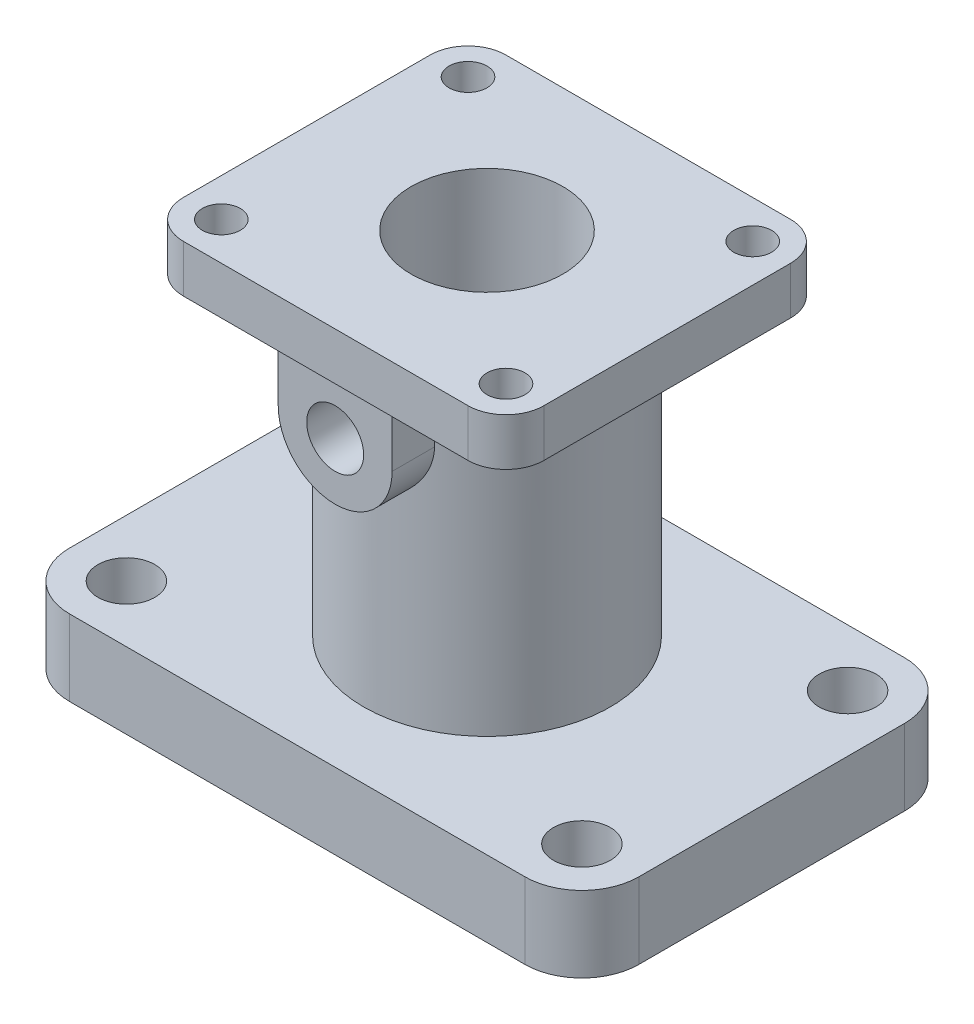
ISO-10303-21;
HEADER;
FILE_DESCRIPTION(('STEP AP214'),'2;1');
FILE_NAME('part.step','',(''),(''),'','','');
FILE_SCHEMA(('AUTOMOTIVE_DESIGN { 1 0 10303 214 1 1 1 1 }'));
ENDSEC;
DATA;
#1=APPLICATION_CONTEXT('core data for automotive mechanical design processes');
#2=APPLICATION_PROTOCOL_DEFINITION('international standard','automotive_design',2000,#1);
#3=PRODUCT_CONTEXT('',#1,'mechanical');
#4=PRODUCT('Part','Part','',(#3));
#5=PRODUCT_RELATED_PRODUCT_CATEGORY('part','',(#4));
#6=PRODUCT_DEFINITION_FORMATION('','',#4);
#7=PRODUCT_DEFINITION_CONTEXT('part definition',#1,'design');
#8=PRODUCT_DEFINITION('design','',#6,#7);
#9=PRODUCT_DEFINITION_SHAPE('','',#8);
#10=(LENGTH_UNIT() NAMED_UNIT(*) SI_UNIT(.MILLI.,.METRE.));
#11=(NAMED_UNIT(*) PLANE_ANGLE_UNIT() SI_UNIT($,.RADIAN.));
#12=(NAMED_UNIT(*) SI_UNIT($,.STERADIAN.) SOLID_ANGLE_UNIT());
#13=UNCERTAINTY_MEASURE_WITH_UNIT(LENGTH_MEASURE(1.E-05),#10,'distance_accuracy_value','');
#14=(GEOMETRIC_REPRESENTATION_CONTEXT(3) GLOBAL_UNCERTAINTY_ASSIGNED_CONTEXT((#13)) GLOBAL_UNIT_ASSIGNED_CONTEXT((#10,
#11,#12)) REPRESENTATION_CONTEXT('',''));
#15=CARTESIAN_POINT('',(0.,0.,0.));
#16=DIRECTION('',(0.,0.,1.));
#17=DIRECTION('',(1.,0.,0.));
#18=AXIS2_PLACEMENT_3D('',#15,#16,#17);
#19=CARTESIAN_POINT('',(-15.,0.,10.));
#20=DIRECTION('',(0.,1.,0.));
#21=DIRECTION('',(0.,0.,1.));
#22=AXIS2_PLACEMENT_3D('',#19,#20,#21);
#23=PLANE('',#22);
#24=DIRECTION('',(0.,0.,1.));
#25=VECTOR('',#24,1.);
#26=CARTESIAN_POINT('',(-15.,0.,-10.));
#27=LINE('',#26,#25);
#28=CARTESIAN_POINT('',(-15.,0.,-7.));
#29=VERTEX_POINT('',#28);
#30=CARTESIAN_POINT('',(-15.,0.,7.));
#31=VERTEX_POINT('',#30);
#32=EDGE_CURVE('E353',#29,#31,#27,.T.);
#33=ORIENTED_EDGE('',*,*,#32,.F.);
#34=CARTESIAN_POINT('',(-12.,0.,-7.));
#35=DIRECTION('',(0.,1.,0.));
#36=DIRECTION('',(0.,0.,1.));
#37=AXIS2_PLACEMENT_3D('',#34,#35,#36);
#38=CIRCLE('',#37,3.);
#39=CARTESIAN_POINT('',(-12.,0.,-10.));
#40=VERTEX_POINT('',#39);
#41=EDGE_CURVE('E392',#29,#40,#38,.F.);
#42=ORIENTED_EDGE('',*,*,#41,.T.);
#43=DIRECTION('',(-1.,0.,0.));
#44=VECTOR('',#43,1.);
#45=CARTESIAN_POINT('',(-15.,0.,-10.));
#46=LINE('',#45,#44);
#47=CARTESIAN_POINT('',(12.,0.,-10.));
#48=VERTEX_POINT('',#47);
#49=EDGE_CURVE('E362',#48,#40,#46,.T.);
#50=ORIENTED_EDGE('',*,*,#49,.F.);
#51=CARTESIAN_POINT('',(12.,0.,-7.));
#52=DIRECTION('',(0.,1.,0.));
#53=DIRECTION('',(0.,0.,1.));
#54=AXIS2_PLACEMENT_3D('',#51,#52,#53);
#55=CIRCLE('',#54,3.);
#56=CARTESIAN_POINT('',(15.,0.,-7.));
#57=VERTEX_POINT('',#56);
#58=EDGE_CURVE('E390',#48,#57,#55,.F.);
#59=ORIENTED_EDGE('',*,*,#58,.T.);
#60=DIRECTION('',(0.,0.,-1.));
#61=VECTOR('',#60,1.);
#62=CARTESIAN_POINT('',(15.,0.,-10.));
#63=LINE('',#62,#61);
#64=CARTESIAN_POINT('',(15.,0.,7.));
#65=VERTEX_POINT('',#64);
#66=EDGE_CURVE('E377',#65,#57,#63,.T.);
#67=ORIENTED_EDGE('',*,*,#66,.F.);
#68=CARTESIAN_POINT('',(12.,0.,7.));
#69=DIRECTION('',(0.,1.,0.));
#70=DIRECTION('',(0.,0.,1.));
#71=AXIS2_PLACEMENT_3D('',#68,#69,#70);
#72=CIRCLE('',#71,3.);
#73=CARTESIAN_POINT('',(12.,0.,10.));
#74=VERTEX_POINT('',#73);
#75=EDGE_CURVE('E386',#65,#74,#72,.F.);
#76=ORIENTED_EDGE('',*,*,#75,.T.);
#77=DIRECTION('',(1.,0.,0.));
#78=VECTOR('',#77,1.);
#79=CARTESIAN_POINT('',(-15.,0.,10.));
#80=LINE('',#79,#78);
#81=CARTESIAN_POINT('',(-12.,0.,10.));
#82=VERTEX_POINT('',#81);
#83=EDGE_CURVE('E374',#82,#74,#80,.T.);
#84=ORIENTED_EDGE('',*,*,#83,.F.);
#85=CARTESIAN_POINT('',(-12.,0.,7.));
#86=DIRECTION('',(0.,1.,0.));
#87=DIRECTION('',(0.,0.,1.));
#88=AXIS2_PLACEMENT_3D('',#85,#86,#87);
#89=CIRCLE('',#88,3.);
#90=EDGE_CURVE('E388',#82,#31,#89,.F.);
#91=ORIENTED_EDGE('',*,*,#90,.T.);
#92=EDGE_LOOP('',(#33,#42,#50,#59,#67,#76,#84,#91));
#93=FACE_BOUND('',#92,.T.);
#94=CARTESIAN_POINT('',(12.,0.,7.));
#95=DIRECTION('',(0.,-1.,0.));
#96=DIRECTION('',(0.,0.,-1.));
#97=AXIS2_PLACEMENT_3D('',#94,#95,#96);
#98=CIRCLE('',#97,1.5);
#99=CARTESIAN_POINT('',(12.,0.,5.5));
#100=VERTEX_POINT('',#99);
#101=EDGE_CURVE('E441',#100,#100,#98,.T.);
#102=ORIENTED_EDGE('',*,*,#101,.F.);
#103=EDGE_LOOP('',(#102));
#104=FACE_BOUND('',#103,.T.);
#105=CARTESIAN_POINT('',(12.,0.,-7.));
#106=DIRECTION('',(0.,-1.,0.));
#107=DIRECTION('',(0.,0.,1.));
#108=AXIS2_PLACEMENT_3D('',#105,#106,#107);
#109=CIRCLE('',#108,1.5);
#110=CARTESIAN_POINT('',(12.,0.,-8.5));
#111=VERTEX_POINT('',#110);
#112=EDGE_CURVE('E449',#111,#111,#109,.T.);
#113=ORIENTED_EDGE('',*,*,#112,.F.);
#114=EDGE_LOOP('',(#113));
#115=FACE_BOUND('',#114,.T.);
#116=CARTESIAN_POINT('',(-12.,0.,-7.));
#117=DIRECTION('',(0.,-1.,0.));
#118=DIRECTION('',(0.,0.,-1.));
#119=AXIS2_PLACEMENT_3D('',#116,#117,#118);
#120=CIRCLE('',#119,1.5);
#121=CARTESIAN_POINT('',(-12.,0.,-8.5));
#122=VERTEX_POINT('',#121);
#123=EDGE_CURVE('E454',#122,#122,#120,.T.);
#124=ORIENTED_EDGE('',*,*,#123,.F.);
#125=EDGE_LOOP('',(#124));
#126=FACE_BOUND('',#125,.T.);
#127=CARTESIAN_POINT('',(-12.,0.,7.));
#128=DIRECTION('',(0.,-1.,0.));
#129=DIRECTION('',(0.,0.,1.));
#130=AXIS2_PLACEMENT_3D('',#127,#128,#129);
#131=CIRCLE('',#130,1.5);
#132=CARTESIAN_POINT('',(-12.,0.,5.5));
#133=VERTEX_POINT('',#132);
#134=EDGE_CURVE('E460',#133,#133,#131,.T.);
#135=ORIENTED_EDGE('',*,*,#134,.F.);
#136=EDGE_LOOP('',(#135));
#137=FACE_BOUND('',#136,.T.);
#138=CARTESIAN_POINT('',(0.,0.,0.));
#139=DIRECTION('',(0.,1.,0.));
#140=DIRECTION('',(-1.,0.,0.));
#141=AXIS2_PLACEMENT_3D('',#138,#139,#140);
#142=CIRCLE('',#141,3.);
#143=CARTESIAN_POINT('',(-3.,0.,0.));
#144=VERTEX_POINT('',#143);
#145=EDGE_CURVE('E492',#144,#144,#142,.T.);
#146=ORIENTED_EDGE('',*,*,#145,.T.);
#147=EDGE_LOOP('',(#146));
#148=FACE_BOUND('',#147,.T.);
#149=ADVANCED_FACE('F46',(#93,#104,#115,#126,#137,#148),#23,.F.);
#150=CARTESIAN_POINT('',(-9.5,22.5,8.5));
#151=DIRECTION('',(0.,1.,0.));
#152=DIRECTION('',(0.,0.,1.));
#153=AXIS2_PLACEMENT_3D('',#150,#151,#152);
#154=PLANE('',#153);
#155=DIRECTION('',(-1.,0.,0.));
#156=VECTOR('',#155,1.);
#157=CARTESIAN_POINT('',(-9.5,22.5,-8.5));
#158=LINE('',#157,#156);
#159=CARTESIAN_POINT('',(7.5,22.5,-8.5));
#160=VERTEX_POINT('',#159);
#161=CARTESIAN_POINT('',(-7.5,22.5,-8.5));
#162=VERTEX_POINT('',#161);
#163=EDGE_CURVE('E357',#160,#162,#158,.T.);
#164=ORIENTED_EDGE('',*,*,#163,.T.);
#165=CARTESIAN_POINT('',(-7.5,22.5,-6.5));
#166=DIRECTION('',(0.,1.,0.));
#167=DIRECTION('',(0.,0.,1.));
#168=AXIS2_PLACEMENT_3D('',#165,#166,#167);
#169=CIRCLE('',#168,2.);
#170=CARTESIAN_POINT('',(-9.5,22.5,-6.5));
#171=VERTEX_POINT('',#170);
#172=EDGE_CURVE('E311',#162,#171,#169,.T.);
#173=ORIENTED_EDGE('',*,*,#172,.T.);
#174=DIRECTION('',(0.,0.,1.));
#175=VECTOR('',#174,1.);
#176=CARTESIAN_POINT('',(-9.5,22.5,-8.5));
#177=LINE('',#176,#175);
#178=CARTESIAN_POINT('',(-9.5,22.5,6.5));
#179=VERTEX_POINT('',#178);
#180=EDGE_CURVE('E332',#171,#179,#177,.T.);
#181=ORIENTED_EDGE('',*,*,#180,.T.);
#182=CARTESIAN_POINT('',(-7.5,22.5,6.5));
#183=DIRECTION('',(0.,1.,0.));
#184=DIRECTION('',(0.,0.,1.));
#185=AXIS2_PLACEMENT_3D('',#182,#183,#184);
#186=CIRCLE('',#185,2.);
#187=CARTESIAN_POINT('',(-7.5,22.5,8.5));
#188=VERTEX_POINT('',#187);
#189=EDGE_CURVE('E303',#179,#188,#186,.T.);
#190=ORIENTED_EDGE('',*,*,#189,.T.);
#191=DIRECTION('',(1.,0.,0.));
#192=VECTOR('',#191,1.);
#193=CARTESIAN_POINT('',(-9.5,22.5,8.5));
#194=LINE('',#193,#192);
#195=CARTESIAN_POINT('',(7.5,22.5,8.5));
#196=VERTEX_POINT('',#195);
#197=EDGE_CURVE('E325',#188,#196,#194,.T.);
#198=ORIENTED_EDGE('',*,*,#197,.T.);
#199=CARTESIAN_POINT('',(7.5,22.5,6.5));
#200=DIRECTION('',(0.,1.,0.));
#201=DIRECTION('',(0.,0.,1.));
#202=AXIS2_PLACEMENT_3D('',#199,#200,#201);
#203=CIRCLE('',#202,2.);
#204=CARTESIAN_POINT('',(9.5,22.5,6.5));
#205=VERTEX_POINT('',#204);
#206=EDGE_CURVE('E309',#196,#205,#203,.T.);
#207=ORIENTED_EDGE('',*,*,#206,.T.);
#208=DIRECTION('',(0.,0.,-1.));
#209=VECTOR('',#208,1.);
#210=CARTESIAN_POINT('',(9.5,22.5,-8.5));
#211=LINE('',#210,#209);
#212=CARTESIAN_POINT('',(9.5,22.5,-6.5));
#213=VERTEX_POINT('',#212);
#214=EDGE_CURVE('E331',#205,#213,#211,.T.);
#215=ORIENTED_EDGE('',*,*,#214,.T.);
#216=CARTESIAN_POINT('',(7.5,22.5,-6.5));
#217=DIRECTION('',(0.,1.,0.));
#218=DIRECTION('',(0.,0.,1.));
#219=AXIS2_PLACEMENT_3D('',#216,#217,#218);
#220=CIRCLE('',#219,2.);
#221=EDGE_CURVE('E308',#213,#160,#220,.T.);
#222=ORIENTED_EDGE('',*,*,#221,.T.);
#223=EDGE_LOOP('',(#164,#173,#181,#190,#198,#207,#215,#222));
#224=FACE_BOUND('',#223,.T.);
#225=CARTESIAN_POINT('',(7.5,22.5,-6.5));
#226=DIRECTION('',(0.,1.,0.));
#227=DIRECTION('',(0.,0.,1.));
#228=AXIS2_PLACEMENT_3D('',#225,#226,#227);
#229=CIRCLE('',#228,1.);
#230=CARTESIAN_POINT('',(7.5,22.5,-5.5));
#231=VERTEX_POINT('',#230);
#232=EDGE_CURVE('E466',#231,#231,#229,.T.);
#233=ORIENTED_EDGE('',*,*,#232,.F.);
#234=EDGE_LOOP('',(#233));
#235=FACE_BOUND('',#234,.T.);
#236=CARTESIAN_POINT('',(7.5,22.5,6.5));
#237=DIRECTION('',(0.,1.,0.));
#238=DIRECTION('',(0.,0.,-1.));
#239=AXIS2_PLACEMENT_3D('',#236,#237,#238);
#240=CIRCLE('',#239,1.);
#241=CARTESIAN_POINT('',(7.5,22.5,7.5));
#242=VERTEX_POINT('',#241);
#243=EDGE_CURVE('E474',#242,#242,#240,.T.);
#244=ORIENTED_EDGE('',*,*,#243,.F.);
#245=EDGE_LOOP('',(#244));
#246=FACE_BOUND('',#245,.T.);
#247=CARTESIAN_POINT('',(-7.5,22.5,6.5));
#248=DIRECTION('',(0.,1.,0.));
#249=DIRECTION('',(0.,0.,1.));
#250=AXIS2_PLACEMENT_3D('',#247,#248,#249);
#251=CIRCLE('',#250,1.);
#252=CARTESIAN_POINT('',(-7.5,22.5,7.5));
#253=VERTEX_POINT('',#252);
#254=EDGE_CURVE('E480',#253,#253,#251,.T.);
#255=ORIENTED_EDGE('',*,*,#254,.F.);
#256=EDGE_LOOP('',(#255));
#257=FACE_BOUND('',#256,.T.);
#258=CARTESIAN_POINT('',(-7.5,22.5,-6.5));
#259=DIRECTION('',(0.,1.,0.));
#260=DIRECTION('',(0.,0.,-1.));
#261=AXIS2_PLACEMENT_3D('',#258,#259,#260);
#262=CIRCLE('',#261,1.);
#263=CARTESIAN_POINT('',(-7.5,22.5,-5.5));
#264=VERTEX_POINT('',#263);
#265=EDGE_CURVE('E486',#264,#264,#262,.T.);
#266=ORIENTED_EDGE('',*,*,#265,.F.);
#267=EDGE_LOOP('',(#266));
#268=FACE_BOUND('',#267,.T.);
#269=CARTESIAN_POINT('',(0.,22.5,0.));
#270=DIRECTION('',(0.,1.,0.));
#271=DIRECTION('',(-1.,0.,0.));
#272=AXIS2_PLACEMENT_3D('',#269,#270,#271);
#273=CIRCLE('',#272,4.);
#274=CARTESIAN_POINT('',(-4.,22.5,0.));
#275=VERTEX_POINT('',#274);
#276=EDGE_CURVE('E501',#275,#275,#273,.T.);
#277=ORIENTED_EDGE('',*,*,#276,.F.);
#278=EDGE_LOOP('',(#277));
#279=FACE_BOUND('',#278,.T.);
#280=ADVANCED_FACE('F238',(#224,#235,#246,#257,#268,#279),#154,.T.);
#281=CARTESIAN_POINT('',(-15.,4.,10.));
#282=DIRECTION('',(0.,1.,0.));
#283=DIRECTION('',(0.,0.,1.));
#284=AXIS2_PLACEMENT_3D('',#281,#282,#283);
#285=PLANE('',#284);
#286=CARTESIAN_POINT('',(-12.,4.,7.));
#287=DIRECTION('',(0.,1.,0.));
#288=DIRECTION('',(0.,0.,1.));
#289=AXIS2_PLACEMENT_3D('',#286,#287,#288);
#290=CIRCLE('',#289,1.5);
#291=CARTESIAN_POINT('',(-12.,4.,5.5));
#292=VERTEX_POINT('',#291);
#293=EDGE_CURVE('E463',#292,#292,#290,.F.);
#294=ORIENTED_EDGE('',*,*,#293,.T.);
#295=EDGE_LOOP('',(#294));
#296=FACE_BOUND('',#295,.T.);
#297=CARTESIAN_POINT('',(-12.,4.,-7.));
#298=DIRECTION('',(0.,1.,0.));
#299=DIRECTION('',(0.,0.,1.));
#300=AXIS2_PLACEMENT_3D('',#297,#298,#299);
#301=CIRCLE('',#300,1.5);
#302=CARTESIAN_POINT('',(-12.,4.,-8.5));
#303=VERTEX_POINT('',#302);
#304=EDGE_CURVE('E457',#303,#303,#301,.F.);
#305=ORIENTED_EDGE('',*,*,#304,.T.);
#306=EDGE_LOOP('',(#305));
#307=FACE_BOUND('',#306,.T.);
#308=CARTESIAN_POINT('',(12.,4.,-7.));
#309=DIRECTION('',(0.,1.,0.));
#310=DIRECTION('',(0.,0.,1.));
#311=AXIS2_PLACEMENT_3D('',#308,#309,#310);
#312=CIRCLE('',#311,1.5);
#313=CARTESIAN_POINT('',(12.,4.,-8.5));
#314=VERTEX_POINT('',#313);
#315=EDGE_CURVE('E451',#314,#314,#312,.F.);
#316=ORIENTED_EDGE('',*,*,#315,.T.);
#317=EDGE_LOOP('',(#316));
#318=FACE_BOUND('',#317,.T.);
#319=CARTESIAN_POINT('',(12.,4.,7.));
#320=DIRECTION('',(0.,1.,0.));
#321=DIRECTION('',(0.,0.,1.));
#322=AXIS2_PLACEMENT_3D('',#319,#320,#321);
#323=CIRCLE('',#322,1.5);
#324=CARTESIAN_POINT('',(12.,4.,5.5));
#325=VERTEX_POINT('',#324);
#326=EDGE_CURVE('E443',#325,#325,#323,.F.);
#327=ORIENTED_EDGE('',*,*,#326,.T.);
#328=EDGE_LOOP('',(#327));
#329=FACE_BOUND('',#328,.T.);
#330=DIRECTION('',(-1.,0.,0.));
#331=VECTOR('',#330,1.);
#332=CARTESIAN_POINT('',(-15.,4.,-10.));
#333=LINE('',#332,#331);
#334=CARTESIAN_POINT('',(12.,4.,-10.));
#335=VERTEX_POINT('',#334);
#336=CARTESIAN_POINT('',(-12.,4.,-10.));
#337=VERTEX_POINT('',#336);
#338=EDGE_CURVE('E368',#335,#337,#333,.T.);
#339=ORIENTED_EDGE('',*,*,#338,.T.);
#340=CARTESIAN_POINT('',(-12.,4.,-7.));
#341=DIRECTION('',(0.,1.,0.));
#342=DIRECTION('',(0.,0.,1.));
#343=AXIS2_PLACEMENT_3D('',#340,#341,#342);
#344=CIRCLE('',#343,3.);
#345=CARTESIAN_POINT('',(-15.,4.,-7.));
#346=VERTEX_POINT('',#345);
#347=EDGE_CURVE('E405',#337,#346,#344,.T.);
#348=ORIENTED_EDGE('',*,*,#347,.T.);
#349=DIRECTION('',(0.,0.,1.));
#350=VECTOR('',#349,1.);
#351=CARTESIAN_POINT('',(-15.,4.,-10.));
#352=LINE('',#351,#350);
#353=CARTESIAN_POINT('',(-15.,4.,7.));
#354=VERTEX_POINT('',#353);
#355=EDGE_CURVE('E358',#346,#354,#352,.T.);
#356=ORIENTED_EDGE('',*,*,#355,.T.);
#357=CARTESIAN_POINT('',(-12.,4.,7.));
#358=DIRECTION('',(0.,1.,0.));
#359=DIRECTION('',(0.,0.,1.));
#360=AXIS2_PLACEMENT_3D('',#357,#358,#359);
#361=CIRCLE('',#360,3.);
#362=CARTESIAN_POINT('',(-12.,4.,10.));
#363=VERTEX_POINT('',#362);
#364=EDGE_CURVE('E401',#354,#363,#361,.T.);
#365=ORIENTED_EDGE('',*,*,#364,.T.);
#366=DIRECTION('',(1.,0.,0.));
#367=VECTOR('',#366,1.);
#368=CARTESIAN_POINT('',(-15.,4.,10.));
#369=LINE('',#368,#367);
#370=CARTESIAN_POINT('',(12.,4.,10.));
#371=VERTEX_POINT('',#370);
#372=EDGE_CURVE('E361',#363,#371,#369,.T.);
#373=ORIENTED_EDGE('',*,*,#372,.T.);
#374=CARTESIAN_POINT('',(12.,4.,7.));
#375=DIRECTION('',(0.,1.,0.));
#376=DIRECTION('',(0.,0.,1.));
#377=AXIS2_PLACEMENT_3D('',#374,#375,#376);
#378=CIRCLE('',#377,3.);
#379=CARTESIAN_POINT('',(15.,4.,7.));
#380=VERTEX_POINT('',#379);
#381=EDGE_CURVE('E399',#371,#380,#378,.T.);
#382=ORIENTED_EDGE('',*,*,#381,.T.);
#383=DIRECTION('',(0.,0.,-1.));
#384=VECTOR('',#383,1.);
#385=CARTESIAN_POINT('',(15.,4.,-10.));
#386=LINE('',#385,#384);
#387=CARTESIAN_POINT('',(15.,4.,-7.));
#388=VERTEX_POINT('',#387);
#389=EDGE_CURVE('E365',#380,#388,#386,.T.);
#390=ORIENTED_EDGE('',*,*,#389,.T.);
#391=CARTESIAN_POINT('',(12.,4.,-7.));
#392=DIRECTION('',(0.,1.,0.));
#393=DIRECTION('',(0.,0.,1.));
#394=AXIS2_PLACEMENT_3D('',#391,#392,#393);
#395=CIRCLE('',#394,3.);
#396=EDGE_CURVE('E403',#388,#335,#395,.T.);
#397=ORIENTED_EDGE('',*,*,#396,.T.);
#398=EDGE_LOOP('',(#339,#348,#356,#365,#373,#382,#390,#397));
#399=FACE_BOUND('',#398,.T.);
#400=CARTESIAN_POINT('',(0.,4.,0.));
#401=DIRECTION('',(0.,1.,0.));
#402=DIRECTION('',(0.,0.,1.));
#403=AXIS2_PLACEMENT_3D('',#400,#401,#402);
#404=CIRCLE('',#403,6.5);
#405=CARTESIAN_POINT('',(0.,4.,6.5));
#406=VERTEX_POINT('',#405);
#407=EDGE_CURVE('E354',#406,#406,#404,.T.);
#408=ORIENTED_EDGE('',*,*,#407,.F.);
#409=EDGE_LOOP('',(#408));
#410=FACE_BOUND('',#409,.T.);
#411=ADVANCED_FACE('F244',(#296,#307,#318,#329,#399,#410),#285,.T.);
#412=CARTESIAN_POINT('',(-15.,4.,-10.));
#413=DIRECTION('',(1.,0.,0.));
#414=DIRECTION('',(0.,0.,-1.));
#415=AXIS2_PLACEMENT_3D('',#412,#413,#414);
#416=PLANE('',#415);
#417=ORIENTED_EDGE('',*,*,#355,.F.);
#418=DIRECTION('',(0.,-1.,0.));
#419=VECTOR('',#418,1.);
#420=CARTESIAN_POINT('',(-15.,4.,-7.));
#421=LINE('',#420,#419);
#422=EDGE_CURVE('E383',#346,#29,#421,.T.);
#423=ORIENTED_EDGE('',*,*,#422,.T.);
#424=ORIENTED_EDGE('',*,*,#32,.T.);
#425=DIRECTION('',(0.,-1.,0.));
#426=VECTOR('',#425,1.);
#427=CARTESIAN_POINT('',(-15.,4.,7.));
#428=LINE('',#427,#426);
#429=EDGE_CURVE('E371',#31,#354,#428,.F.);
#430=ORIENTED_EDGE('',*,*,#429,.T.);
#431=EDGE_LOOP('',(#417,#423,#424,#430));
#432=FACE_BOUND('',#431,.T.);
#433=ADVANCED_FACE('F264',(#432),#416,.F.);
#434=CARTESIAN_POINT('',(-15.,4.,10.));
#435=DIRECTION('',(0.,0.,-1.));
#436=DIRECTION('',(-1.,0.,0.));
#437=AXIS2_PLACEMENT_3D('',#434,#435,#436);
#438=PLANE('',#437);
#439=ORIENTED_EDGE('',*,*,#372,.F.);
#440=DIRECTION('',(0.,-1.,0.));
#441=VECTOR('',#440,1.);
#442=CARTESIAN_POINT('',(-12.,4.,10.));
#443=LINE('',#442,#441);
#444=EDGE_CURVE('E414',#363,#82,#443,.T.);
#445=ORIENTED_EDGE('',*,*,#444,.T.);
#446=ORIENTED_EDGE('',*,*,#83,.T.);
#447=DIRECTION('',(0.,-1.,0.));
#448=VECTOR('',#447,1.);
#449=CARTESIAN_POINT('',(12.,4.,10.));
#450=LINE('',#449,#448);
#451=EDGE_CURVE('E412',#74,#371,#450,.F.);
#452=ORIENTED_EDGE('',*,*,#451,.T.);
#453=EDGE_LOOP('',(#439,#445,#446,#452));
#454=FACE_BOUND('',#453,.T.);
#455=ADVANCED_FACE('F260',(#454),#438,.F.);
#456=CARTESIAN_POINT('',(15.,4.,-10.));
#457=DIRECTION('',(-1.,0.,0.));
#458=DIRECTION('',(0.,0.,1.));
#459=AXIS2_PLACEMENT_3D('',#456,#457,#458);
#460=PLANE('',#459);
#461=ORIENTED_EDGE('',*,*,#66,.T.);
#462=DIRECTION('',(0.,-1.,0.));
#463=VECTOR('',#462,1.);
#464=CARTESIAN_POINT('',(15.,4.,-7.));
#465=LINE('',#464,#463);
#466=EDGE_CURVE('E410',#57,#388,#465,.F.);
#467=ORIENTED_EDGE('',*,*,#466,.T.);
#468=ORIENTED_EDGE('',*,*,#389,.F.);
#469=DIRECTION('',(0.,-1.,0.));
#470=VECTOR('',#469,1.);
#471=CARTESIAN_POINT('',(15.,4.,7.));
#472=LINE('',#471,#470);
#473=EDGE_CURVE('E407',#380,#65,#472,.T.);
#474=ORIENTED_EDGE('',*,*,#473,.T.);
#475=EDGE_LOOP('',(#461,#467,#468,#474));
#476=FACE_BOUND('',#475,.T.);
#477=ADVANCED_FACE('F256',(#476),#460,.F.);
#478=CARTESIAN_POINT('',(-15.,4.,-10.));
#479=DIRECTION('',(0.,0.,1.));
#480=DIRECTION('',(1.,0.,0.));
#481=AXIS2_PLACEMENT_3D('',#478,#479,#480);
#482=PLANE('',#481);
#483=ORIENTED_EDGE('',*,*,#49,.T.);
#484=DIRECTION('',(0.,-1.,0.));
#485=VECTOR('',#484,1.);
#486=CARTESIAN_POINT('',(-12.,4.,-10.));
#487=LINE('',#486,#485);
#488=EDGE_CURVE('E397',#40,#337,#487,.F.);
#489=ORIENTED_EDGE('',*,*,#488,.T.);
#490=ORIENTED_EDGE('',*,*,#338,.F.);
#491=DIRECTION('',(0.,-1.,0.));
#492=VECTOR('',#491,1.);
#493=CARTESIAN_POINT('',(12.,4.,-10.));
#494=LINE('',#493,#492);
#495=EDGE_CURVE('E394',#335,#48,#494,.T.);
#496=ORIENTED_EDGE('',*,*,#495,.T.);
#497=EDGE_LOOP('',(#483,#489,#490,#496));
#498=FACE_BOUND('',#497,.T.);
#499=ADVANCED_FACE('F252',(#498),#482,.F.);
#500=CARTESIAN_POINT('',(-12.,4.,-7.));
#501=DIRECTION('',(0.,-1.,0.));
#502=DIRECTION('',(0.,0.,-1.));
#503=AXIS2_PLACEMENT_3D('',#500,#501,#502);
#504=CYLINDRICAL_SURFACE('',#503,3.);
#505=ORIENTED_EDGE('',*,*,#347,.F.);
#506=ORIENTED_EDGE('',*,*,#488,.F.);
#507=ORIENTED_EDGE('',*,*,#41,.F.);
#508=ORIENTED_EDGE('',*,*,#422,.F.);
#509=EDGE_LOOP('',(#505,#506,#507,#508));
#510=FACE_BOUND('',#509,.T.);
#511=ADVANCED_FACE('F255',(#510),#504,.T.);
#512=CARTESIAN_POINT('',(12.,4.,-7.));
#513=DIRECTION('',(0.,-1.,0.));
#514=DIRECTION('',(0.,0.,-1.));
#515=AXIS2_PLACEMENT_3D('',#512,#513,#514);
#516=CYLINDRICAL_SURFACE('',#515,3.);
#517=ORIENTED_EDGE('',*,*,#396,.F.);
#518=ORIENTED_EDGE('',*,*,#466,.F.);
#519=ORIENTED_EDGE('',*,*,#58,.F.);
#520=ORIENTED_EDGE('',*,*,#495,.F.);
#521=EDGE_LOOP('',(#517,#518,#519,#520));
#522=FACE_BOUND('',#521,.T.);
#523=ADVANCED_FACE('F271',(#522),#516,.T.);
#524=CARTESIAN_POINT('',(-12.,4.,7.));
#525=DIRECTION('',(0.,-1.,0.));
#526=DIRECTION('',(0.,0.,-1.));
#527=AXIS2_PLACEMENT_3D('',#524,#525,#526);
#528=CYLINDRICAL_SURFACE('',#527,3.);
#529=ORIENTED_EDGE('',*,*,#364,.F.);
#530=ORIENTED_EDGE('',*,*,#429,.F.);
#531=ORIENTED_EDGE('',*,*,#90,.F.);
#532=ORIENTED_EDGE('',*,*,#444,.F.);
#533=EDGE_LOOP('',(#529,#530,#531,#532));
#534=FACE_BOUND('',#533,.T.);
#535=ADVANCED_FACE('F275',(#534),#528,.T.);
#536=CARTESIAN_POINT('',(12.,4.,7.));
#537=DIRECTION('',(0.,-1.,0.));
#538=DIRECTION('',(0.,0.,-1.));
#539=AXIS2_PLACEMENT_3D('',#536,#537,#538);
#540=CYLINDRICAL_SURFACE('',#539,3.);
#541=ORIENTED_EDGE('',*,*,#381,.F.);
#542=ORIENTED_EDGE('',*,*,#451,.F.);
#543=ORIENTED_EDGE('',*,*,#75,.F.);
#544=ORIENTED_EDGE('',*,*,#473,.F.);
#545=EDGE_LOOP('',(#541,#542,#543,#544));
#546=FACE_BOUND('',#545,.T.);
#547=ADVANCED_FACE('F279',(#546),#540,.T.);
#548=CARTESIAN_POINT('',(0.,20.,0.));
#549=DIRECTION('',(0.,-1.,0.));
#550=DIRECTION('',(0.,0.,-1.));
#551=AXIS2_PLACEMENT_3D('',#548,#549,#550);
#552=CYLINDRICAL_SURFACE('',#551,6.5);
#553=CARTESIAN_POINT('',(-3.,17.,5.7662812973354));
#554=CARTESIAN_POINT('',(-3.00001325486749,16.9205460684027,5.76626092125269));
#555=CARTESIAN_POINT('',(-2.99684395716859,16.8411033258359,5.76792298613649));
#556=CARTESIAN_POINT('',(-2.98424426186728,16.6828885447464,5.77445907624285));
#557=CARTESIAN_POINT('',(-2.97481707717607,16.6041161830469,5.77933145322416));
#558=CARTESIAN_POINT('',(-2.94986780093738,16.4481975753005,5.79210360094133));
#559=CARTESIAN_POINT('',(-2.93437634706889,16.371045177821,5.79998814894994));
#560=CARTESIAN_POINT('',(-2.8974900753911,16.218517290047,5.81850289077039));
#561=CARTESIAN_POINT('',(-2.87609471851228,16.1431419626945,5.82913333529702));
#562=CARTESIAN_POINT('',(-2.80344872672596,15.9206790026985,5.8646056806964));
#563=CARTESIAN_POINT('',(-2.74367253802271,15.7768519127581,5.89306438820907));
#564=CARTESIAN_POINT('',(-2.6033712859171,15.5011777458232,5.95637113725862));
#565=CARTESIAN_POINT('',(-2.52281912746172,15.3693466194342,5.99122750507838));
#566=CARTESIAN_POINT('',(-2.33672447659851,15.1114281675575,6.06633769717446));
#567=CARTESIAN_POINT('',(-2.22983981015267,14.9863671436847,6.10679805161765));
#568=CARTESIAN_POINT('',(-1.99693926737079,14.755189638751,6.18687262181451));
#569=CARTESIAN_POINT('',(-1.87091876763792,14.6490777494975,6.22648663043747));
#570=CARTESIAN_POINT('',(-1.59474472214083,14.4530392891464,6.30304778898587));
#571=CARTESIAN_POINT('',(-1.44364024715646,14.3643370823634,6.33972510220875));
#572=CARTESIAN_POINT('',(-1.12664825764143,14.2140748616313,6.40365031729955));
#573=CARTESIAN_POINT('',(-0.960768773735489,14.1525002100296,6.43090330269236));
#574=CARTESIAN_POINT('',(-0.629868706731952,14.0621740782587,6.47142154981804));
#575=CARTESIAN_POINT('',(-0.465435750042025,14.0316201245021,6.4854510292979));
#576=CARTESIAN_POINT('',(-0.133218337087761,13.998320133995,6.50075755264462));
#577=CARTESIAN_POINT('',(0.0345644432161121,13.9955605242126,6.50204082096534));
#578=CARTESIAN_POINT('',(0.355384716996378,14.0171120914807,6.49211498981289));
#579=CARTESIAN_POINT('',(0.508590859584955,14.0394253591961,6.48182781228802));
#580=CARTESIAN_POINT('',(0.808793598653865,14.1069861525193,6.45124986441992));
#581=CARTESIAN_POINT('',(0.955789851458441,14.1522349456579,6.43095854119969));
#582=CARTESIAN_POINT('',(1.24211196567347,14.2648237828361,6.38189566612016));
#583=CARTESIAN_POINT('',(1.38128946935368,14.3324854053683,6.35300132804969));
#584=CARTESIAN_POINT('',(1.64667796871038,14.4876098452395,6.28944357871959));
#585=CARTESIAN_POINT('',(1.77288397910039,14.575080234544,6.25477796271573));
#586=CARTESIAN_POINT('',(2.01997062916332,14.7757891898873,6.17962435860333));
#587=CARTESIAN_POINT('',(2.13952681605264,14.8905694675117,6.1388918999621));
#588=CARTESIAN_POINT('',(2.35835109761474,15.1383986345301,6.05820178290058));
#589=CARTESIAN_POINT('',(2.45760519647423,15.2714600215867,6.01824467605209));
#590=CARTESIAN_POINT('',(2.63764698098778,15.5601867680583,5.94162278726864));
#591=CARTESIAN_POINT('',(2.7173097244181,15.7166339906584,5.90521061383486));
#592=CARTESIAN_POINT('',(2.81569663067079,15.9609719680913,5.85859720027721));
#593=CARTESIAN_POINT('',(2.84496710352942,16.0439949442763,5.8443975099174));
#594=CARTESIAN_POINT('',(2.89619757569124,16.2127242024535,5.8191794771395));
#595=CARTESIAN_POINT('',(2.91816079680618,16.2984292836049,5.80815973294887));
#596=CARTESIAN_POINT('',(2.95738281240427,16.4857646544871,5.78830560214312));
#597=CARTESIAN_POINT('',(2.97332046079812,16.5877428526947,5.78010598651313));
#598=CARTESIAN_POINT('',(2.99465167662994,16.7931378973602,5.76906317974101));
#599=CARTESIAN_POINT('',(3.00003902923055,16.8965555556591,5.76622314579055));
#600=CARTESIAN_POINT('',(3.,17.,5.7662812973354));
#601=B_SPLINE_CURVE_WITH_KNOTS('',3,(#553,#554,#555,#556,#557,#558,#559,#560,#561,#562,#563,
#564,#565,#566,#567,#568,#569,#570,#571,#572,#573,#574,#575,#576,#577,#578,#579,#580,#581,#582,
#583,#584,#585,#586,#587,#588,#589,#590,#591,#592,#593,#594,#595,#596,#597,#598,#599,#600),
.UNSPECIFIED.,.F.,.F.,(4,2,2,2,2,2,2,2,2,2,2,2,2,2,2,2,2,2,2,2,2,2,2,4),(0.,0.238262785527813,
0.476403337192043,0.713355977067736,0.950330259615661,1.42306618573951,1.89642177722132,
2.40248498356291,2.90867065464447,3.44293565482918,3.9769120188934,4.47769426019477,
4.9782319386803,5.44154616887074,5.90488600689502,6.37518467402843,6.84566341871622,
7.35542436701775,7.86553555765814,8.40031176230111,8.6674918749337,8.93455402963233,
9.24448664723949,9.5546017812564),.UNSPECIFIED.);
#602=CARTESIAN_POINT('',(-3.,17.,5.76628129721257));
#603=VERTEX_POINT('',#602);
#604=CARTESIAN_POINT('',(3.,17.,5.76628129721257));
#605=VERTEX_POINT('',#604);
#606=EDGE_CURVE('E187',#603,#605,#601,.T.);
#607=ORIENTED_EDGE('',*,*,#606,.F.);
#608=DIRECTION('',(0.,-1.,0.));
#609=VECTOR('',#608,1.);
#610=CARTESIAN_POINT('',(-3.,20.,5.7662812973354));
#611=LINE('',#610,#609);
#612=CARTESIAN_POINT('',(-3.,20.,5.76628129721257));
#613=VERTEX_POINT('',#612);
#614=EDGE_CURVE('E203',#613,#603,#611,.T.);
#615=ORIENTED_EDGE('',*,*,#614,.F.);
#616=CARTESIAN_POINT('',(0.,20.,0.));
#617=DIRECTION('',(0.,1.,0.));
#618=DIRECTION('',(0.,0.,1.));
#619=AXIS2_PLACEMENT_3D('',#616,#617,#618);
#620=CIRCLE('',#619,6.5);
#621=CARTESIAN_POINT('',(3.,20.,5.7662812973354));
#622=VERTEX_POINT('',#621);
#623=EDGE_CURVE('E209',#622,#613,#620,.T.);
#624=ORIENTED_EDGE('',*,*,#623,.F.);
#625=DIRECTION('',(0.,-1.,0.));
#626=VECTOR('',#625,1.);
#627=CARTESIAN_POINT('',(3.,20.,5.7662812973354));
#628=LINE('',#627,#626);
#629=EDGE_CURVE('E196',#605,#622,#628,.F.);
#630=ORIENTED_EDGE('',*,*,#629,.F.);
#631=EDGE_LOOP('',(#607,#615,#624,#630));
#632=FACE_BOUND('',#631,.T.);
#633=ORIENTED_EDGE('',*,*,#407,.T.);
#634=EDGE_LOOP('',(#633));
#635=FACE_BOUND('',#634,.T.);
#636=ADVANCED_FACE('F206',(#632,#635),#552,.T.);
#637=CARTESIAN_POINT('',(-9.5,20.,8.5));
#638=DIRECTION('',(0.,1.,0.));
#639=DIRECTION('',(0.,0.,1.));
#640=AXIS2_PLACEMENT_3D('',#637,#638,#639);
#641=PLANE('',#640);
#642=ORIENTED_EDGE('',*,*,#623,.T.);
#643=DIRECTION('',(0.,0.,1.));
#644=VECTOR('',#643,1.);
#645=CARTESIAN_POINT('',(-3.,20.,-500000.));
#646=LINE('',#645,#644);
#647=CARTESIAN_POINT('',(-3.,20.,8.));
#648=VERTEX_POINT('',#647);
#649=EDGE_CURVE('E505',#613,#648,#646,.T.);
#650=ORIENTED_EDGE('',*,*,#649,.T.);
#651=DIRECTION('',(-1.,0.,0.));
#652=VECTOR('',#651,1.);
#653=CARTESIAN_POINT('',(3.,20.,8.));
#654=LINE('',#653,#652);
#655=CARTESIAN_POINT('',(3.,20.,8.));
#656=VERTEX_POINT('',#655);
#657=EDGE_CURVE('E515',#656,#648,#654,.T.);
#658=ORIENTED_EDGE('',*,*,#657,.F.);
#659=DIRECTION('',(0.,0.,1.));
#660=VECTOR('',#659,1.);
#661=CARTESIAN_POINT('',(3.,20.,-500000.));
#662=LINE('',#661,#660);
#663=EDGE_CURVE('E202',#622,#656,#662,.T.);
#664=ORIENTED_EDGE('',*,*,#663,.F.);
#665=EDGE_LOOP('',(#642,#650,#658,#664));
#666=FACE_BOUND('',#665,.T.);
#667=CARTESIAN_POINT('',(-7.5,20.,-6.5));
#668=DIRECTION('',(0.,1.,0.));
#669=DIRECTION('',(0.,0.,1.));
#670=AXIS2_PLACEMENT_3D('',#667,#668,#669);
#671=CIRCLE('',#670,1.);
#672=CARTESIAN_POINT('',(-7.5,20.,-5.5));
#673=VERTEX_POINT('',#672);
#674=EDGE_CURVE('E489',#673,#673,#671,.F.);
#675=ORIENTED_EDGE('',*,*,#674,.F.);
#676=EDGE_LOOP('',(#675));
#677=FACE_BOUND('',#676,.T.);
#678=CARTESIAN_POINT('',(-7.5,20.,6.5));
#679=DIRECTION('',(0.,1.,0.));
#680=DIRECTION('',(0.,0.,1.));
#681=AXIS2_PLACEMENT_3D('',#678,#679,#680);
#682=CIRCLE('',#681,1.);
#683=CARTESIAN_POINT('',(-7.5,20.,7.5));
#684=VERTEX_POINT('',#683);
#685=EDGE_CURVE('E483',#684,#684,#682,.F.);
#686=ORIENTED_EDGE('',*,*,#685,.F.);
#687=EDGE_LOOP('',(#686));
#688=FACE_BOUND('',#687,.T.);
#689=CARTESIAN_POINT('',(7.5,20.,6.5));
#690=DIRECTION('',(0.,1.,0.));
#691=DIRECTION('',(0.,0.,1.));
#692=AXIS2_PLACEMENT_3D('',#689,#690,#691);
#693=CIRCLE('',#692,1.);
#694=CARTESIAN_POINT('',(7.5,20.,7.5));
#695=VERTEX_POINT('',#694);
#696=EDGE_CURVE('E477',#695,#695,#693,.F.);
#697=ORIENTED_EDGE('',*,*,#696,.F.);
#698=EDGE_LOOP('',(#697));
#699=FACE_BOUND('',#698,.T.);
#700=CARTESIAN_POINT('',(7.5,20.,-6.5));
#701=DIRECTION('',(0.,1.,0.));
#702=DIRECTION('',(0.,0.,1.));
#703=AXIS2_PLACEMENT_3D('',#700,#701,#702);
#704=CIRCLE('',#703,1.);
#705=CARTESIAN_POINT('',(7.5,20.,-5.5));
#706=VERTEX_POINT('',#705);
#707=EDGE_CURVE('E471',#706,#706,#704,.F.);
#708=ORIENTED_EDGE('',*,*,#707,.F.);
#709=EDGE_LOOP('',(#708));
#710=FACE_BOUND('',#709,.T.);
#711=DIRECTION('',(0.,0.,1.));
#712=VECTOR('',#711,1.);
#713=CARTESIAN_POINT('',(-9.5,20.,-8.5));
#714=LINE('',#713,#712);
#715=CARTESIAN_POINT('',(-9.5,20.,-6.5));
#716=VERTEX_POINT('',#715);
#717=CARTESIAN_POINT('',(-9.5,20.,6.5));
#718=VERTEX_POINT('',#717);
#719=EDGE_CURVE('E348',#716,#718,#714,.T.);
#720=ORIENTED_EDGE('',*,*,#719,.F.);
#721=CARTESIAN_POINT('',(-7.5,20.,-6.5));
#722=DIRECTION('',(0.,1.,0.));
#723=DIRECTION('',(0.,0.,1.));
#724=AXIS2_PLACEMENT_3D('',#721,#722,#723);
#725=CIRCLE('',#724,2.);
#726=CARTESIAN_POINT('',(-7.5,20.,-8.5));
#727=VERTEX_POINT('',#726);
#728=EDGE_CURVE('E425',#716,#727,#725,.F.);
#729=ORIENTED_EDGE('',*,*,#728,.T.);
#730=DIRECTION('',(-1.,0.,0.));
#731=VECTOR('',#730,1.);
#732=CARTESIAN_POINT('',(-9.5,20.,-8.5));
#733=LINE('',#732,#731);
#734=CARTESIAN_POINT('',(7.5,20.,-8.5));
#735=VERTEX_POINT('',#734);
#736=EDGE_CURVE('E344',#735,#727,#733,.T.);
#737=ORIENTED_EDGE('',*,*,#736,.F.);
#738=CARTESIAN_POINT('',(7.5,20.,-6.5));
#739=DIRECTION('',(0.,1.,0.));
#740=DIRECTION('',(0.,0.,1.));
#741=AXIS2_PLACEMENT_3D('',#738,#739,#740);
#742=CIRCLE('',#741,2.);
#743=CARTESIAN_POINT('',(9.5,20.,-6.5));
#744=VERTEX_POINT('',#743);
#745=EDGE_CURVE('E343',#735,#744,#742,.F.);
#746=ORIENTED_EDGE('',*,*,#745,.T.);
#747=DIRECTION('',(0.,0.,-1.));
#748=VECTOR('',#747,1.);
#749=CARTESIAN_POINT('',(9.5,20.,-8.5));
#750=LINE('',#749,#748);
#751=CARTESIAN_POINT('',(9.5,20.,6.5));
#752=VERTEX_POINT('',#751);
#753=EDGE_CURVE('E338',#752,#744,#750,.T.);
#754=ORIENTED_EDGE('',*,*,#753,.F.);
#755=CARTESIAN_POINT('',(7.5,20.,6.5));
#756=DIRECTION('',(0.,1.,0.));
#757=DIRECTION('',(0.,0.,1.));
#758=AXIS2_PLACEMENT_3D('',#755,#756,#757);
#759=CIRCLE('',#758,2.);
#760=CARTESIAN_POINT('',(7.5,20.,8.5));
#761=VERTEX_POINT('',#760);
#762=EDGE_CURVE('E335',#752,#761,#759,.F.);
#763=ORIENTED_EDGE('',*,*,#762,.T.);
#764=DIRECTION('',(1.,0.,0.));
#765=VECTOR('',#764,1.);
#766=CARTESIAN_POINT('',(-9.5,20.,8.5));
#767=LINE('',#766,#765);
#768=CARTESIAN_POINT('',(-7.5,20.,8.5));
#769=VERTEX_POINT('',#768);
#770=EDGE_CURVE('E327',#769,#761,#767,.T.);
#771=ORIENTED_EDGE('',*,*,#770,.F.);
#772=CARTESIAN_POINT('',(-7.5,20.,6.5));
#773=DIRECTION('',(0.,1.,0.));
#774=DIRECTION('',(0.,0.,1.));
#775=AXIS2_PLACEMENT_3D('',#772,#773,#774);
#776=CIRCLE('',#775,2.);
#777=EDGE_CURVE('E422',#769,#718,#776,.F.);
#778=ORIENTED_EDGE('',*,*,#777,.T.);
#779=EDGE_LOOP('',(#720,#729,#737,#746,#754,#763,#771,#778));
#780=FACE_BOUND('',#779,.T.);
#781=ADVANCED_FACE('F341',(#666,#677,#688,#699,#710,#780),#641,.F.);
#782=CARTESIAN_POINT('',(-9.5,22.5,-8.5));
#783=DIRECTION('',(1.,0.,0.));
#784=DIRECTION('',(0.,0.,-1.));
#785=AXIS2_PLACEMENT_3D('',#782,#783,#784);
#786=PLANE('',#785);
#787=ORIENTED_EDGE('',*,*,#180,.F.);
#788=DIRECTION('',(0.,-1.,0.));
#789=VECTOR('',#788,1.);
#790=CARTESIAN_POINT('',(-9.5,22.5,-6.5));
#791=LINE('',#790,#789);
#792=EDGE_CURVE('E418',#171,#716,#791,.T.);
#793=ORIENTED_EDGE('',*,*,#792,.T.);
#794=ORIENTED_EDGE('',*,*,#719,.T.);
#795=DIRECTION('',(0.,-1.,0.));
#796=VECTOR('',#795,1.);
#797=CARTESIAN_POINT('',(-9.5,22.5,6.5));
#798=LINE('',#797,#796);
#799=EDGE_CURVE('E304',#718,#179,#798,.F.);
#800=ORIENTED_EDGE('',*,*,#799,.T.);
#801=EDGE_LOOP('',(#787,#793,#794,#800));
#802=FACE_BOUND('',#801,.T.);
#803=ADVANCED_FACE('F440',(#802),#786,.F.);
#804=CARTESIAN_POINT('',(-9.5,22.5,8.5));
#805=DIRECTION('',(0.,0.,-1.));
#806=DIRECTION('',(-1.,0.,0.));
#807=AXIS2_PLACEMENT_3D('',#804,#805,#806);
#808=PLANE('',#807);
#809=ORIENTED_EDGE('',*,*,#197,.F.);
#810=DIRECTION('',(0.,-1.,0.));
#811=VECTOR('',#810,1.);
#812=CARTESIAN_POINT('',(-7.5,22.5,8.5));
#813=LINE('',#812,#811);
#814=EDGE_CURVE('E12',#188,#769,#813,.T.);
#815=ORIENTED_EDGE('',*,*,#814,.T.);
#816=ORIENTED_EDGE('',*,*,#770,.T.);
#817=DIRECTION('',(0.,-1.,0.));
#818=VECTOR('',#817,1.);
#819=CARTESIAN_POINT('',(7.5,22.5,8.5));
#820=LINE('',#819,#818);
#821=EDGE_CURVE('E54',#761,#196,#820,.F.);
#822=ORIENTED_EDGE('',*,*,#821,.T.);
#823=EDGE_LOOP('',(#809,#815,#816,#822));
#824=FACE_BOUND('',#823,.T.);
#825=ADVANCED_FACE('F324',(#824),#808,.F.);
#826=CARTESIAN_POINT('',(9.5,22.5,-8.5));
#827=DIRECTION('',(-1.,0.,0.));
#828=DIRECTION('',(0.,0.,1.));
#829=AXIS2_PLACEMENT_3D('',#826,#827,#828);
#830=PLANE('',#829);
#831=ORIENTED_EDGE('',*,*,#753,.T.);
#832=DIRECTION('',(0.,-1.,0.));
#833=VECTOR('',#832,1.);
#834=CARTESIAN_POINT('',(9.5,22.5,-6.5));
#835=LINE('',#834,#833);
#836=EDGE_CURVE('E69',#744,#213,#835,.F.);
#837=ORIENTED_EDGE('',*,*,#836,.T.);
#838=ORIENTED_EDGE('',*,*,#214,.F.);
#839=DIRECTION('',(0.,-1.,0.));
#840=VECTOR('',#839,1.);
#841=CARTESIAN_POINT('',(9.5,22.5,6.5));
#842=LINE('',#841,#840);
#843=EDGE_CURVE('E318',#205,#752,#842,.T.);
#844=ORIENTED_EDGE('',*,*,#843,.T.);
#845=EDGE_LOOP('',(#831,#837,#838,#844));
#846=FACE_BOUND('',#845,.T.);
#847=ADVANCED_FACE('F337',(#846),#830,.F.);
#848=CARTESIAN_POINT('',(-9.5,22.5,-8.5));
#849=DIRECTION('',(0.,0.,1.));
#850=DIRECTION('',(1.,0.,0.));
#851=AXIS2_PLACEMENT_3D('',#848,#849,#850);
#852=PLANE('',#851);
#853=ORIENTED_EDGE('',*,*,#736,.T.);
#854=DIRECTION('',(0.,-1.,0.));
#855=VECTOR('',#854,1.);
#856=CARTESIAN_POINT('',(-7.5,22.5,-8.5));
#857=LINE('',#856,#855);
#858=EDGE_CURVE('E313',#727,#162,#857,.F.);
#859=ORIENTED_EDGE('',*,*,#858,.T.);
#860=ORIENTED_EDGE('',*,*,#163,.F.);
#861=DIRECTION('',(0.,-1.,0.));
#862=VECTOR('',#861,1.);
#863=CARTESIAN_POINT('',(7.5,22.5,-8.5));
#864=LINE('',#863,#862);
#865=EDGE_CURVE('E427',#160,#735,#864,.T.);
#866=ORIENTED_EDGE('',*,*,#865,.T.);
#867=EDGE_LOOP('',(#853,#859,#860,#866));
#868=FACE_BOUND('',#867,.T.);
#869=ADVANCED_FACE('F288',(#868),#852,.F.);
#870=CARTESIAN_POINT('',(-7.5,22.5,-6.5));
#871=DIRECTION('',(0.,-1.,0.));
#872=DIRECTION('',(0.,0.,-1.));
#873=AXIS2_PLACEMENT_3D('',#870,#871,#872);
#874=CYLINDRICAL_SURFACE('',#873,2.);
#875=ORIENTED_EDGE('',*,*,#172,.F.);
#876=ORIENTED_EDGE('',*,*,#858,.F.);
#877=ORIENTED_EDGE('',*,*,#728,.F.);
#878=ORIENTED_EDGE('',*,*,#792,.F.);
#879=EDGE_LOOP('',(#875,#876,#877,#878));
#880=FACE_BOUND('',#879,.T.);
#881=ADVANCED_FACE('F284',(#880),#874,.T.);
#882=CARTESIAN_POINT('',(7.5,22.5,-6.5));
#883=DIRECTION('',(0.,-1.,0.));
#884=DIRECTION('',(0.,0.,-1.));
#885=AXIS2_PLACEMENT_3D('',#882,#883,#884);
#886=CYLINDRICAL_SURFACE('',#885,2.);
#887=ORIENTED_EDGE('',*,*,#221,.F.);
#888=ORIENTED_EDGE('',*,*,#836,.F.);
#889=ORIENTED_EDGE('',*,*,#745,.F.);
#890=ORIENTED_EDGE('',*,*,#865,.F.);
#891=EDGE_LOOP('',(#887,#888,#889,#890));
#892=FACE_BOUND('',#891,.T.);
#893=ADVANCED_FACE('F287',(#892),#886,.T.);
#894=CARTESIAN_POINT('',(-7.5,22.5,6.5));
#895=DIRECTION('',(0.,-1.,0.));
#896=DIRECTION('',(0.,0.,-1.));
#897=AXIS2_PLACEMENT_3D('',#894,#895,#896);
#898=CYLINDRICAL_SURFACE('',#897,2.);
#899=ORIENTED_EDGE('',*,*,#189,.F.);
#900=ORIENTED_EDGE('',*,*,#799,.F.);
#901=ORIENTED_EDGE('',*,*,#777,.F.);
#902=ORIENTED_EDGE('',*,*,#814,.F.);
#903=EDGE_LOOP('',(#899,#900,#901,#902));
#904=FACE_BOUND('',#903,.T.);
#905=ADVANCED_FACE('F291',(#904),#898,.T.);
#906=CARTESIAN_POINT('',(7.5,22.5,6.5));
#907=DIRECTION('',(0.,-1.,0.));
#908=DIRECTION('',(0.,0.,-1.));
#909=AXIS2_PLACEMENT_3D('',#906,#907,#908);
#910=CYLINDRICAL_SURFACE('',#909,2.);
#911=ORIENTED_EDGE('',*,*,#206,.F.);
#912=ORIENTED_EDGE('',*,*,#821,.F.);
#913=ORIENTED_EDGE('',*,*,#762,.F.);
#914=ORIENTED_EDGE('',*,*,#843,.F.);
#915=EDGE_LOOP('',(#911,#912,#913,#914));
#916=FACE_BOUND('',#915,.T.);
#917=ADVANCED_FACE('F48',(#916),#910,.T.);
#918=CARTESIAN_POINT('',(12.,22.501,7.));
#919=DIRECTION('',(0.,-1.,0.));
#920=DIRECTION('',(0.,0.,-1.));
#921=AXIS2_PLACEMENT_3D('',#918,#919,#920);
#922=CYLINDRICAL_SURFACE('',#921,1.5);
#923=CARTESIAN_POINT('',(12.,4.,5.5));
#924=CARTESIAN_POINT('',(12.,3.95833333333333,5.5));
#925=CARTESIAN_POINT('',(12.,3.91666666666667,5.5));
#926=CARTESIAN_POINT('',(12.,3.83333333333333,5.5));
#927=CARTESIAN_POINT('',(12.,3.79166666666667,5.5));
#928=CARTESIAN_POINT('',(12.,3.70833333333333,5.5));
#929=CARTESIAN_POINT('',(12.,3.66666666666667,5.5));
#930=CARTESIAN_POINT('',(12.,3.58333333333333,5.5));
#931=CARTESIAN_POINT('',(12.,3.54166666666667,5.5));
#932=CARTESIAN_POINT('',(12.,3.45833333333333,5.5));
#933=CARTESIAN_POINT('',(12.,3.41666666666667,5.5));
#934=CARTESIAN_POINT('',(12.,3.33333333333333,5.5));
#935=CARTESIAN_POINT('',(12.,3.29166666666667,5.5));
#936=CARTESIAN_POINT('',(12.,3.20833333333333,5.5));
#937=CARTESIAN_POINT('',(12.,3.16666666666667,5.5));
#938=CARTESIAN_POINT('',(12.,3.08333333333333,5.5));
#939=CARTESIAN_POINT('',(12.,3.04166666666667,5.5));
#940=CARTESIAN_POINT('',(12.,2.95833333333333,5.5));
#941=CARTESIAN_POINT('',(12.,2.91666666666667,5.5));
#942=CARTESIAN_POINT('',(12.,2.83333333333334,5.5));
#943=CARTESIAN_POINT('',(12.,2.79166666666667,5.5));
#944=CARTESIAN_POINT('',(12.,2.70833333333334,5.5));
#945=CARTESIAN_POINT('',(12.,2.66666666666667,5.5));
#946=CARTESIAN_POINT('',(12.,2.58333333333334,5.5));
#947=CARTESIAN_POINT('',(12.,2.54166666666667,5.5));
#948=CARTESIAN_POINT('',(12.,2.45833333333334,5.5));
#949=CARTESIAN_POINT('',(12.,2.41666666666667,5.5));
#950=CARTESIAN_POINT('',(12.,2.33333333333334,5.5));
#951=CARTESIAN_POINT('',(12.,2.29166666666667,5.5));
#952=CARTESIAN_POINT('',(12.,2.20833333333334,5.5));
#953=CARTESIAN_POINT('',(12.,2.16666666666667,5.5));
#954=CARTESIAN_POINT('',(12.,2.08333333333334,5.5));
#955=CARTESIAN_POINT('',(12.,2.04166666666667,5.5));
#956=CARTESIAN_POINT('',(12.,1.95833333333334,5.5));
#957=CARTESIAN_POINT('',(12.,1.91666666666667,5.5));
#958=CARTESIAN_POINT('',(12.,1.83333333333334,5.5));
#959=CARTESIAN_POINT('',(12.,1.79166666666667,5.5));
#960=CARTESIAN_POINT('',(12.,1.70833333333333,5.5));
#961=CARTESIAN_POINT('',(12.,1.66666666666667,5.5));
#962=CARTESIAN_POINT('',(12.,1.58333333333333,5.5));
#963=CARTESIAN_POINT('',(12.,1.54166666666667,5.5));
#964=CARTESIAN_POINT('',(12.,1.45833333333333,5.5));
#965=CARTESIAN_POINT('',(12.,1.41666666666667,5.5));
#966=CARTESIAN_POINT('',(12.,1.33333333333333,5.5));
#967=CARTESIAN_POINT('',(12.,1.29166666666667,5.5));
#968=CARTESIAN_POINT('',(12.,1.20833333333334,5.5));
#969=CARTESIAN_POINT('',(12.,1.16666666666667,5.5));
#970=CARTESIAN_POINT('',(12.,1.08333333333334,5.5));
#971=CARTESIAN_POINT('',(12.,1.04166666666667,5.5));
#972=CARTESIAN_POINT('',(12.,0.958333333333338,5.5));
#973=CARTESIAN_POINT('',(12.,0.916666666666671,5.5));
#974=CARTESIAN_POINT('',(12.,0.833333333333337,5.5));
#975=CARTESIAN_POINT('',(12.,0.791666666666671,5.5));
#976=CARTESIAN_POINT('',(12.,0.708333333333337,5.5));
#977=CARTESIAN_POINT('',(12.,0.666666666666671,5.5));
#978=CARTESIAN_POINT('',(12.,0.583333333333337,5.5));
#979=CARTESIAN_POINT('',(12.,0.541666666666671,5.5));
#980=CARTESIAN_POINT('',(12.,0.458333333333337,5.5));
#981=CARTESIAN_POINT('',(12.,0.416666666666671,5.5));
#982=CARTESIAN_POINT('',(12.,0.333333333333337,5.5));
#983=CARTESIAN_POINT('',(12.,0.29166666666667,5.5));
#984=CARTESIAN_POINT('',(12.,0.208333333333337,5.5));
#985=CARTESIAN_POINT('',(12.,0.16666666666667,5.5));
#986=CARTESIAN_POINT('',(12.,0.0833333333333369,5.5));
#987=CARTESIAN_POINT('',(12.,0.0416666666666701,5.5));
#988=CARTESIAN_POINT('',(12.,0.,5.5));
#989=B_SPLINE_CURVE_WITH_KNOTS('',3,(#923,#924,#925,#926,#927,#928,#929,#930,#931,#932,#933,
#934,#935,#936,#937,#938,#939,#940,#941,#942,#943,#944,#945,#946,#947,#948,#949,#950,#951,#952,
#953,#954,#955,#956,#957,#958,#959,#960,#961,#962,#963,#964,#965,#966,#967,#968,#969,#970,#971,
#972,#973,#974,#975,#976,#977,#978,#979,#980,#981,#982,#983,#984,#985,#986,#987,#988),
.UNSPECIFIED.,.F.,.F.,(4,2,2,2,2,2,2,2,2,2,2,2,2,2,2,2,2,2,2,2,2,2,2,2,2,2,2,2,2,2,2,2,4),(0.,
0.125,0.25,0.375,0.5,0.625000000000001,0.750000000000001,0.875000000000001,1.,1.125,1.25,1.375,
1.5,1.625,1.75,1.875,2.,2.125,2.25,2.375,2.5,2.625,2.75,2.875,3.,3.125,3.25,3.375,3.5,3.625,
3.75,3.875,4.),.UNSPECIFIED.);
#990=EDGE_CURVE('BSEAM298',#325,#100,#989,.T.);
#991=ORIENTED_EDGE('',*,*,#326,.F.);
#992=ORIENTED_EDGE('',*,*,#101,.T.);
#993=ORIENTED_EDGE('',*,*,#990,.T.);
#994=ORIENTED_EDGE('',*,*,#990,.F.);
#995=EDGE_LOOP('',(#991,#993,#992,#994));
#996=FACE_BOUND('',#995,.T.);
#997=ADVANCED_FACE('F298',(#996),#922,.F.);
#998=CARTESIAN_POINT('',(12.,22.501,-7.));
#999=DIRECTION('',(0.,-1.,0.));
#1000=DIRECTION('',(0.,0.,-1.));
#1001=AXIS2_PLACEMENT_3D('',#998,#999,#1000);
#1002=CYLINDRICAL_SURFACE('',#1001,1.5);
#1003=CARTESIAN_POINT('',(12.,4.,-8.5));
#1004=CARTESIAN_POINT('',(12.,3.95833333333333,-8.5));
#1005=CARTESIAN_POINT('',(12.,3.91666666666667,-8.5));
#1006=CARTESIAN_POINT('',(12.,3.83333333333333,-8.5));
#1007=CARTESIAN_POINT('',(12.,3.79166666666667,-8.5));
#1008=CARTESIAN_POINT('',(12.,3.70833333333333,-8.5));
#1009=CARTESIAN_POINT('',(12.,3.66666666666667,-8.5));
#1010=CARTESIAN_POINT('',(12.,3.58333333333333,-8.5));
#1011=CARTESIAN_POINT('',(12.,3.54166666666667,-8.5));
#1012=CARTESIAN_POINT('',(12.,3.45833333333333,-8.5));
#1013=CARTESIAN_POINT('',(12.,3.41666666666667,-8.5));
#1014=CARTESIAN_POINT('',(12.,3.33333333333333,-8.5));
#1015=CARTESIAN_POINT('',(12.,3.29166666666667,-8.5));
#1016=CARTESIAN_POINT('',(12.,3.20833333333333,-8.5));
#1017=CARTESIAN_POINT('',(12.,3.16666666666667,-8.5));
#1018=CARTESIAN_POINT('',(12.,3.08333333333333,-8.5));
#1019=CARTESIAN_POINT('',(12.,3.04166666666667,-8.5));
#1020=CARTESIAN_POINT('',(12.,2.95833333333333,-8.5));
#1021=CARTESIAN_POINT('',(12.,2.91666666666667,-8.5));
#1022=CARTESIAN_POINT('',(12.,2.83333333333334,-8.5));
#1023=CARTESIAN_POINT('',(12.,2.79166666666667,-8.5));
#1024=CARTESIAN_POINT('',(12.,2.70833333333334,-8.5));
#1025=CARTESIAN_POINT('',(12.,2.66666666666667,-8.5));
#1026=CARTESIAN_POINT('',(12.,2.58333333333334,-8.5));
#1027=CARTESIAN_POINT('',(12.,2.54166666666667,-8.5));
#1028=CARTESIAN_POINT('',(12.,2.45833333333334,-8.5));
#1029=CARTESIAN_POINT('',(12.,2.41666666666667,-8.5));
#1030=CARTESIAN_POINT('',(12.,2.33333333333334,-8.5));
#1031=CARTESIAN_POINT('',(12.,2.29166666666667,-8.5));
#1032=CARTESIAN_POINT('',(12.,2.20833333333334,-8.5));
#1033=CARTESIAN_POINT('',(12.,2.16666666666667,-8.5));
#1034=CARTESIAN_POINT('',(12.,2.08333333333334,-8.5));
#1035=CARTESIAN_POINT('',(12.,2.04166666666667,-8.5));
#1036=CARTESIAN_POINT('',(12.,1.95833333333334,-8.5));
#1037=CARTESIAN_POINT('',(12.,1.91666666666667,-8.5));
#1038=CARTESIAN_POINT('',(12.,1.83333333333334,-8.5));
#1039=CARTESIAN_POINT('',(12.,1.79166666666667,-8.5));
#1040=CARTESIAN_POINT('',(12.,1.70833333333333,-8.5));
#1041=CARTESIAN_POINT('',(12.,1.66666666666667,-8.5));
#1042=CARTESIAN_POINT('',(12.,1.58333333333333,-8.5));
#1043=CARTESIAN_POINT('',(12.,1.54166666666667,-8.5));
#1044=CARTESIAN_POINT('',(12.,1.45833333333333,-8.5));
#1045=CARTESIAN_POINT('',(12.,1.41666666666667,-8.5));
#1046=CARTESIAN_POINT('',(12.,1.33333333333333,-8.5));
#1047=CARTESIAN_POINT('',(12.,1.29166666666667,-8.5));
#1048=CARTESIAN_POINT('',(12.,1.20833333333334,-8.5));
#1049=CARTESIAN_POINT('',(12.,1.16666666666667,-8.5));
#1050=CARTESIAN_POINT('',(12.,1.08333333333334,-8.5));
#1051=CARTESIAN_POINT('',(12.,1.04166666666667,-8.5));
#1052=CARTESIAN_POINT('',(12.,0.958333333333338,-8.5));
#1053=CARTESIAN_POINT('',(12.,0.916666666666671,-8.5));
#1054=CARTESIAN_POINT('',(12.,0.833333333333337,-8.5));
#1055=CARTESIAN_POINT('',(12.,0.791666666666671,-8.5));
#1056=CARTESIAN_POINT('',(12.,0.708333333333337,-8.5));
#1057=CARTESIAN_POINT('',(12.,0.666666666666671,-8.5));
#1058=CARTESIAN_POINT('',(12.,0.583333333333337,-8.5));
#1059=CARTESIAN_POINT('',(12.,0.541666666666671,-8.5));
#1060=CARTESIAN_POINT('',(12.,0.458333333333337,-8.5));
#1061=CARTESIAN_POINT('',(12.,0.416666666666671,-8.5));
#1062=CARTESIAN_POINT('',(12.,0.333333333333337,-8.5));
#1063=CARTESIAN_POINT('',(12.,0.29166666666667,-8.5));
#1064=CARTESIAN_POINT('',(12.,0.208333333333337,-8.5));
#1065=CARTESIAN_POINT('',(12.,0.16666666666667,-8.5));
#1066=CARTESIAN_POINT('',(12.,0.0833333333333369,-8.5));
#1067=CARTESIAN_POINT('',(12.,0.0416666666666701,-8.5));
#1068=CARTESIAN_POINT('',(12.,0.,-8.5));
#1069=B_SPLINE_CURVE_WITH_KNOTS('',3,(#1003,#1004,#1005,#1006,#1007,#1008,#1009,#1010,#1011,
#1012,#1013,#1014,#1015,#1016,#1017,#1018,#1019,#1020,#1021,#1022,#1023,#1024,#1025,#1026,#1027,
#1028,#1029,#1030,#1031,#1032,#1033,#1034,#1035,#1036,#1037,#1038,#1039,#1040,#1041,#1042,#1043,
#1044,#1045,#1046,#1047,#1048,#1049,#1050,#1051,#1052,#1053,#1054,#1055,#1056,#1057,#1058,#1059,
#1060,#1061,#1062,#1063,#1064,#1065,#1066,#1067,#1068),.UNSPECIFIED.,.F.,.F.,(4,2,2,2,2,2,2,2,2,
2,2,2,2,2,2,2,2,2,2,2,2,2,2,2,2,2,2,2,2,2,2,2,4),(0.,0.125,0.25,0.375,0.5,0.625000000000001,
0.750000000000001,0.875000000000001,1.,1.125,1.25,1.375,1.5,1.625,1.75,1.875,2.,2.125,2.25,
2.375,2.5,2.625,2.75,2.875,3.,3.125,3.25,3.375,3.5,3.625,3.75,3.875,4.),.UNSPECIFIED.);
#1070=EDGE_CURVE('BSEAM570',#314,#111,#1069,.T.);
#1071=ORIENTED_EDGE('',*,*,#315,.F.);
#1072=ORIENTED_EDGE('',*,*,#112,.T.);
#1073=ORIENTED_EDGE('',*,*,#1070,.T.);
#1074=ORIENTED_EDGE('',*,*,#1070,.F.);
#1075=EDGE_LOOP('',(#1071,#1073,#1072,#1074));
#1076=FACE_BOUND('',#1075,.T.);
#1077=ADVANCED_FACE('F570',(#1076),#1002,.F.);
#1078=CARTESIAN_POINT('',(-12.,22.501,-7.));
#1079=DIRECTION('',(0.,-1.,0.));
#1080=DIRECTION('',(0.,0.,-1.));
#1081=AXIS2_PLACEMENT_3D('',#1078,#1079,#1080);
#1082=CYLINDRICAL_SURFACE('',#1081,1.5);
#1083=CARTESIAN_POINT('',(-12.,4.,-8.5));
#1084=CARTESIAN_POINT('',(-12.,3.95833333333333,-8.5));
#1085=CARTESIAN_POINT('',(-12.,3.91666666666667,-8.5));
#1086=CARTESIAN_POINT('',(-12.,3.83333333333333,-8.5));
#1087=CARTESIAN_POINT('',(-12.,3.79166666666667,-8.5));
#1088=CARTESIAN_POINT('',(-12.,3.70833333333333,-8.5));
#1089=CARTESIAN_POINT('',(-12.,3.66666666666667,-8.5));
#1090=CARTESIAN_POINT('',(-12.,3.58333333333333,-8.5));
#1091=CARTESIAN_POINT('',(-12.,3.54166666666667,-8.5));
#1092=CARTESIAN_POINT('',(-12.,3.45833333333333,-8.5));
#1093=CARTESIAN_POINT('',(-12.,3.41666666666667,-8.5));
#1094=CARTESIAN_POINT('',(-12.,3.33333333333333,-8.5));
#1095=CARTESIAN_POINT('',(-12.,3.29166666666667,-8.5));
#1096=CARTESIAN_POINT('',(-12.,3.20833333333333,-8.5));
#1097=CARTESIAN_POINT('',(-12.,3.16666666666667,-8.5));
#1098=CARTESIAN_POINT('',(-12.,3.08333333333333,-8.5));
#1099=CARTESIAN_POINT('',(-12.,3.04166666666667,-8.5));
#1100=CARTESIAN_POINT('',(-12.,2.95833333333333,-8.5));
#1101=CARTESIAN_POINT('',(-12.,2.91666666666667,-8.5));
#1102=CARTESIAN_POINT('',(-12.,2.83333333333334,-8.5));
#1103=CARTESIAN_POINT('',(-12.,2.79166666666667,-8.5));
#1104=CARTESIAN_POINT('',(-12.,2.70833333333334,-8.5));
#1105=CARTESIAN_POINT('',(-12.,2.66666666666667,-8.5));
#1106=CARTESIAN_POINT('',(-12.,2.58333333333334,-8.5));
#1107=CARTESIAN_POINT('',(-12.,2.54166666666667,-8.5));
#1108=CARTESIAN_POINT('',(-12.,2.45833333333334,-8.5));
#1109=CARTESIAN_POINT('',(-12.,2.41666666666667,-8.5));
#1110=CARTESIAN_POINT('',(-12.,2.33333333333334,-8.5));
#1111=CARTESIAN_POINT('',(-12.,2.29166666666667,-8.5));
#1112=CARTESIAN_POINT('',(-12.,2.20833333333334,-8.5));
#1113=CARTESIAN_POINT('',(-12.,2.16666666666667,-8.5));
#1114=CARTESIAN_POINT('',(-12.,2.08333333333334,-8.5));
#1115=CARTESIAN_POINT('',(-12.,2.04166666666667,-8.5));
#1116=CARTESIAN_POINT('',(-12.,1.95833333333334,-8.5));
#1117=CARTESIAN_POINT('',(-12.,1.91666666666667,-8.5));
#1118=CARTESIAN_POINT('',(-12.,1.83333333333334,-8.5));
#1119=CARTESIAN_POINT('',(-12.,1.79166666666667,-8.5));
#1120=CARTESIAN_POINT('',(-12.,1.70833333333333,-8.5));
#1121=CARTESIAN_POINT('',(-12.,1.66666666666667,-8.5));
#1122=CARTESIAN_POINT('',(-12.,1.58333333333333,-8.5));
#1123=CARTESIAN_POINT('',(-12.,1.54166666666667,-8.5));
#1124=CARTESIAN_POINT('',(-12.,1.45833333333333,-8.5));
#1125=CARTESIAN_POINT('',(-12.,1.41666666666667,-8.5));
#1126=CARTESIAN_POINT('',(-12.,1.33333333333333,-8.5));
#1127=CARTESIAN_POINT('',(-12.,1.29166666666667,-8.5));
#1128=CARTESIAN_POINT('',(-12.,1.20833333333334,-8.5));
#1129=CARTESIAN_POINT('',(-12.,1.16666666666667,-8.5));
#1130=CARTESIAN_POINT('',(-12.,1.08333333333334,-8.5));
#1131=CARTESIAN_POINT('',(-12.,1.04166666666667,-8.5));
#1132=CARTESIAN_POINT('',(-12.,0.958333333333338,-8.5));
#1133=CARTESIAN_POINT('',(-12.,0.916666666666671,-8.5));
#1134=CARTESIAN_POINT('',(-12.,0.833333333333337,-8.5));
#1135=CARTESIAN_POINT('',(-12.,0.791666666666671,-8.5));
#1136=CARTESIAN_POINT('',(-12.,0.708333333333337,-8.5));
#1137=CARTESIAN_POINT('',(-12.,0.666666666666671,-8.5));
#1138=CARTESIAN_POINT('',(-12.,0.583333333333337,-8.5));
#1139=CARTESIAN_POINT('',(-12.,0.541666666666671,-8.5));
#1140=CARTESIAN_POINT('',(-12.,0.458333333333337,-8.5));
#1141=CARTESIAN_POINT('',(-12.,0.416666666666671,-8.5));
#1142=CARTESIAN_POINT('',(-12.,0.333333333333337,-8.5));
#1143=CARTESIAN_POINT('',(-12.,0.29166666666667,-8.5));
#1144=CARTESIAN_POINT('',(-12.,0.208333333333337,-8.5));
#1145=CARTESIAN_POINT('',(-12.,0.16666666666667,-8.5));
#1146=CARTESIAN_POINT('',(-12.,0.0833333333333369,-8.5));
#1147=CARTESIAN_POINT('',(-12.,0.0416666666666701,-8.5));
#1148=CARTESIAN_POINT('',(-12.,0.,-8.5));
#1149=B_SPLINE_CURVE_WITH_KNOTS('',3,(#1083,#1084,#1085,#1086,#1087,#1088,#1089,#1090,#1091,
#1092,#1093,#1094,#1095,#1096,#1097,#1098,#1099,#1100,#1101,#1102,#1103,#1104,#1105,#1106,#1107,
#1108,#1109,#1110,#1111,#1112,#1113,#1114,#1115,#1116,#1117,#1118,#1119,#1120,#1121,#1122,#1123,
#1124,#1125,#1126,#1127,#1128,#1129,#1130,#1131,#1132,#1133,#1134,#1135,#1136,#1137,#1138,#1139,
#1140,#1141,#1142,#1143,#1144,#1145,#1146,#1147,#1148),.UNSPECIFIED.,.F.,.F.,(4,2,2,2,2,2,2,2,2,
2,2,2,2,2,2,2,2,2,2,2,2,2,2,2,2,2,2,2,2,2,2,2,4),(0.,0.125,0.25,0.375,0.5,0.625000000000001,
0.750000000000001,0.875000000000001,1.,1.125,1.25,1.375,1.5,1.625,1.75,1.875,2.,2.125,2.25,
2.375,2.5,2.625,2.75,2.875,3.,3.125,3.25,3.375,3.5,3.625,3.75,3.875,4.),.UNSPECIFIED.);
#1150=EDGE_CURVE('BSEAM566',#303,#122,#1149,.T.);
#1151=ORIENTED_EDGE('',*,*,#304,.F.);
#1152=ORIENTED_EDGE('',*,*,#123,.T.);
#1153=ORIENTED_EDGE('',*,*,#1150,.T.);
#1154=ORIENTED_EDGE('',*,*,#1150,.F.);
#1155=EDGE_LOOP('',(#1151,#1153,#1152,#1154));
#1156=FACE_BOUND('',#1155,.T.);
#1157=ADVANCED_FACE('F566',(#1156),#1082,.F.);
#1158=CARTESIAN_POINT('',(-12.,22.501,7.));
#1159=DIRECTION('',(0.,-1.,0.));
#1160=DIRECTION('',(0.,0.,-1.));
#1161=AXIS2_PLACEMENT_3D('',#1158,#1159,#1160);
#1162=CYLINDRICAL_SURFACE('',#1161,1.5);
#1163=CARTESIAN_POINT('',(-12.,4.,5.5));
#1164=CARTESIAN_POINT('',(-12.,3.95833333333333,5.5));
#1165=CARTESIAN_POINT('',(-12.,3.91666666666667,5.5));
#1166=CARTESIAN_POINT('',(-12.,3.83333333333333,5.5));
#1167=CARTESIAN_POINT('',(-12.,3.79166666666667,5.5));
#1168=CARTESIAN_POINT('',(-12.,3.70833333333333,5.5));
#1169=CARTESIAN_POINT('',(-12.,3.66666666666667,5.5));
#1170=CARTESIAN_POINT('',(-12.,3.58333333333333,5.5));
#1171=CARTESIAN_POINT('',(-12.,3.54166666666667,5.5));
#1172=CARTESIAN_POINT('',(-12.,3.45833333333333,5.5));
#1173=CARTESIAN_POINT('',(-12.,3.41666666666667,5.5));
#1174=CARTESIAN_POINT('',(-12.,3.33333333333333,5.5));
#1175=CARTESIAN_POINT('',(-12.,3.29166666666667,5.5));
#1176=CARTESIAN_POINT('',(-12.,3.20833333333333,5.5));
#1177=CARTESIAN_POINT('',(-12.,3.16666666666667,5.5));
#1178=CARTESIAN_POINT('',(-12.,3.08333333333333,5.5));
#1179=CARTESIAN_POINT('',(-12.,3.04166666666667,5.5));
#1180=CARTESIAN_POINT('',(-12.,2.95833333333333,5.5));
#1181=CARTESIAN_POINT('',(-12.,2.91666666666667,5.5));
#1182=CARTESIAN_POINT('',(-12.,2.83333333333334,5.5));
#1183=CARTESIAN_POINT('',(-12.,2.79166666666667,5.5));
#1184=CARTESIAN_POINT('',(-12.,2.70833333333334,5.5));
#1185=CARTESIAN_POINT('',(-12.,2.66666666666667,5.5));
#1186=CARTESIAN_POINT('',(-12.,2.58333333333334,5.5));
#1187=CARTESIAN_POINT('',(-12.,2.54166666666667,5.5));
#1188=CARTESIAN_POINT('',(-12.,2.45833333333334,5.5));
#1189=CARTESIAN_POINT('',(-12.,2.41666666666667,5.5));
#1190=CARTESIAN_POINT('',(-12.,2.33333333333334,5.5));
#1191=CARTESIAN_POINT('',(-12.,2.29166666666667,5.5));
#1192=CARTESIAN_POINT('',(-12.,2.20833333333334,5.5));
#1193=CARTESIAN_POINT('',(-12.,2.16666666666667,5.5));
#1194=CARTESIAN_POINT('',(-12.,2.08333333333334,5.5));
#1195=CARTESIAN_POINT('',(-12.,2.04166666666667,5.5));
#1196=CARTESIAN_POINT('',(-12.,1.95833333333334,5.5));
#1197=CARTESIAN_POINT('',(-12.,1.91666666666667,5.5));
#1198=CARTESIAN_POINT('',(-12.,1.83333333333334,5.5));
#1199=CARTESIAN_POINT('',(-12.,1.79166666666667,5.5));
#1200=CARTESIAN_POINT('',(-12.,1.70833333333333,5.5));
#1201=CARTESIAN_POINT('',(-12.,1.66666666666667,5.5));
#1202=CARTESIAN_POINT('',(-12.,1.58333333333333,5.5));
#1203=CARTESIAN_POINT('',(-12.,1.54166666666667,5.5));
#1204=CARTESIAN_POINT('',(-12.,1.45833333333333,5.5));
#1205=CARTESIAN_POINT('',(-12.,1.41666666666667,5.5));
#1206=CARTESIAN_POINT('',(-12.,1.33333333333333,5.5));
#1207=CARTESIAN_POINT('',(-12.,1.29166666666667,5.5));
#1208=CARTESIAN_POINT('',(-12.,1.20833333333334,5.5));
#1209=CARTESIAN_POINT('',(-12.,1.16666666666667,5.5));
#1210=CARTESIAN_POINT('',(-12.,1.08333333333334,5.5));
#1211=CARTESIAN_POINT('',(-12.,1.04166666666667,5.5));
#1212=CARTESIAN_POINT('',(-12.,0.958333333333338,5.5));
#1213=CARTESIAN_POINT('',(-12.,0.916666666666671,5.5));
#1214=CARTESIAN_POINT('',(-12.,0.833333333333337,5.5));
#1215=CARTESIAN_POINT('',(-12.,0.791666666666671,5.5));
#1216=CARTESIAN_POINT('',(-12.,0.708333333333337,5.5));
#1217=CARTESIAN_POINT('',(-12.,0.666666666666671,5.5));
#1218=CARTESIAN_POINT('',(-12.,0.583333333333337,5.5));
#1219=CARTESIAN_POINT('',(-12.,0.541666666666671,5.5));
#1220=CARTESIAN_POINT('',(-12.,0.458333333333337,5.5));
#1221=CARTESIAN_POINT('',(-12.,0.416666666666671,5.5));
#1222=CARTESIAN_POINT('',(-12.,0.333333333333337,5.5));
#1223=CARTESIAN_POINT('',(-12.,0.29166666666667,5.5));
#1224=CARTESIAN_POINT('',(-12.,0.208333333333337,5.5));
#1225=CARTESIAN_POINT('',(-12.,0.16666666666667,5.5));
#1226=CARTESIAN_POINT('',(-12.,0.0833333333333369,5.5));
#1227=CARTESIAN_POINT('',(-12.,0.0416666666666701,5.5));
#1228=CARTESIAN_POINT('',(-12.,0.,5.5));
#1229=B_SPLINE_CURVE_WITH_KNOTS('',3,(#1163,#1164,#1165,#1166,#1167,#1168,#1169,#1170,#1171,
#1172,#1173,#1174,#1175,#1176,#1177,#1178,#1179,#1180,#1181,#1182,#1183,#1184,#1185,#1186,#1187,
#1188,#1189,#1190,#1191,#1192,#1193,#1194,#1195,#1196,#1197,#1198,#1199,#1200,#1201,#1202,#1203,
#1204,#1205,#1206,#1207,#1208,#1209,#1210,#1211,#1212,#1213,#1214,#1215,#1216,#1217,#1218,#1219,
#1220,#1221,#1222,#1223,#1224,#1225,#1226,#1227,#1228),.UNSPECIFIED.,.F.,.F.,(4,2,2,2,2,2,2,2,2,
2,2,2,2,2,2,2,2,2,2,2,2,2,2,2,2,2,2,2,2,2,2,2,4),(0.,0.125,0.25,0.375,0.5,0.625000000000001,
0.750000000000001,0.875000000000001,1.,1.125,1.25,1.375,1.5,1.625,1.75,1.875,2.,2.125,2.25,
2.375,2.5,2.625,2.75,2.875,3.,3.125,3.25,3.375,3.5,3.625,3.75,3.875,4.),.UNSPECIFIED.);
#1230=EDGE_CURVE('BSEAM562',#292,#133,#1229,.T.);
#1231=ORIENTED_EDGE('',*,*,#293,.F.);
#1232=ORIENTED_EDGE('',*,*,#134,.T.);
#1233=ORIENTED_EDGE('',*,*,#1230,.T.);
#1234=ORIENTED_EDGE('',*,*,#1230,.F.);
#1235=EDGE_LOOP('',(#1231,#1233,#1232,#1234));
#1236=FACE_BOUND('',#1235,.T.);
#1237=ADVANCED_FACE('F562',(#1236),#1162,.F.);
#1238=CARTESIAN_POINT('',(7.5,-0.001000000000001,-6.5));
#1239=DIRECTION('',(0.,1.,0.));
#1240=DIRECTION('',(0.,0.,1.));
#1241=AXIS2_PLACEMENT_3D('',#1238,#1239,#1240);
#1242=CYLINDRICAL_SURFACE('',#1241,1.);
#1243=CARTESIAN_POINT('',(7.5,22.5,-5.5));
#1244=CARTESIAN_POINT('',(7.5,22.4739583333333,-5.5));
#1245=CARTESIAN_POINT('',(7.5,22.4479166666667,-5.5));
#1246=CARTESIAN_POINT('',(7.5,22.3958333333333,-5.5));
#1247=CARTESIAN_POINT('',(7.5,22.3697916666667,-5.5));
#1248=CARTESIAN_POINT('',(7.5,22.3177083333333,-5.5));
#1249=CARTESIAN_POINT('',(7.5,22.2916666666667,-5.5));
#1250=CARTESIAN_POINT('',(7.5,22.2395833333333,-5.5));
#1251=CARTESIAN_POINT('',(7.5,22.2135416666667,-5.5));
#1252=CARTESIAN_POINT('',(7.5,22.1614583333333,-5.5));
#1253=CARTESIAN_POINT('',(7.5,22.1354166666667,-5.5));
#1254=CARTESIAN_POINT('',(7.5,22.0833333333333,-5.5));
#1255=CARTESIAN_POINT('',(7.5,22.0572916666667,-5.5));
#1256=CARTESIAN_POINT('',(7.5,22.0052083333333,-5.5));
#1257=CARTESIAN_POINT('',(7.5,21.9791666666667,-5.5));
#1258=CARTESIAN_POINT('',(7.5,21.9270833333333,-5.5));
#1259=CARTESIAN_POINT('',(7.5,21.9010416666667,-5.5));
#1260=CARTESIAN_POINT('',(7.5,21.8489583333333,-5.5));
#1261=CARTESIAN_POINT('',(7.5,21.8229166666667,-5.5));
#1262=CARTESIAN_POINT('',(7.5,21.7708333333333,-5.5));
#1263=CARTESIAN_POINT('',(7.5,21.7447916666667,-5.5));
#1264=CARTESIAN_POINT('',(7.5,21.6927083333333,-5.5));
#1265=CARTESIAN_POINT('',(7.5,21.6666666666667,-5.5));
#1266=CARTESIAN_POINT('',(7.5,21.6145833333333,-5.5));
#1267=CARTESIAN_POINT('',(7.5,21.5885416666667,-5.5));
#1268=CARTESIAN_POINT('',(7.5,21.5364583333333,-5.5));
#1269=CARTESIAN_POINT('',(7.5,21.5104166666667,-5.5));
#1270=CARTESIAN_POINT('',(7.5,21.4583333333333,-5.5));
#1271=CARTESIAN_POINT('',(7.5,21.4322916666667,-5.5));
#1272=CARTESIAN_POINT('',(7.5,21.3802083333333,-5.5));
#1273=CARTESIAN_POINT('',(7.5,21.3541666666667,-5.5));
#1274=CARTESIAN_POINT('',(7.5,21.3020833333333,-5.5));
#1275=CARTESIAN_POINT('',(7.5,21.2760416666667,-5.5));
#1276=CARTESIAN_POINT('',(7.5,21.2239583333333,-5.5));
#1277=CARTESIAN_POINT('',(7.5,21.1979166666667,-5.5));
#1278=CARTESIAN_POINT('',(7.5,21.1458333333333,-5.5));
#1279=CARTESIAN_POINT('',(7.5,21.1197916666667,-5.5));
#1280=CARTESIAN_POINT('',(7.5,21.0677083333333,-5.5));
#1281=CARTESIAN_POINT('',(7.5,21.0416666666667,-5.5));
#1282=CARTESIAN_POINT('',(7.5,20.9895833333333,-5.5));
#1283=CARTESIAN_POINT('',(7.5,20.9635416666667,-5.5));
#1284=CARTESIAN_POINT('',(7.5,20.9114583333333,-5.5));
#1285=CARTESIAN_POINT('',(7.5,20.8854166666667,-5.5));
#1286=CARTESIAN_POINT('',(7.5,20.8333333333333,-5.5));
#1287=CARTESIAN_POINT('',(7.5,20.8072916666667,-5.5));
#1288=CARTESIAN_POINT('',(7.5,20.7552083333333,-5.5));
#1289=CARTESIAN_POINT('',(7.5,20.7291666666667,-5.5));
#1290=CARTESIAN_POINT('',(7.5,20.6770833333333,-5.5));
#1291=CARTESIAN_POINT('',(7.5,20.6510416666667,-5.5));
#1292=CARTESIAN_POINT('',(7.5,20.5989583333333,-5.5));
#1293=CARTESIAN_POINT('',(7.5,20.5729166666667,-5.5));
#1294=CARTESIAN_POINT('',(7.5,20.5208333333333,-5.5));
#1295=CARTESIAN_POINT('',(7.5,20.4947916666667,-5.5));
#1296=CARTESIAN_POINT('',(7.5,20.4427083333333,-5.5));
#1297=CARTESIAN_POINT('',(7.5,20.4166666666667,-5.5));
#1298=CARTESIAN_POINT('',(7.5,20.3645833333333,-5.5));
#1299=CARTESIAN_POINT('',(7.5,20.3385416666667,-5.5));
#1300=CARTESIAN_POINT('',(7.5,20.2864583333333,-5.5));
#1301=CARTESIAN_POINT('',(7.5,20.2604166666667,-5.5));
#1302=CARTESIAN_POINT('',(7.5,20.2083333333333,-5.5));
#1303=CARTESIAN_POINT('',(7.5,20.1822916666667,-5.5));
#1304=CARTESIAN_POINT('',(7.5,20.1302083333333,-5.5));
#1305=CARTESIAN_POINT('',(7.5,20.1041666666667,-5.5));
#1306=CARTESIAN_POINT('',(7.5,20.0520833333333,-5.5));
#1307=CARTESIAN_POINT('',(7.5,20.0260416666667,-5.5));
#1308=CARTESIAN_POINT('',(7.5,20.,-5.5));
#1309=B_SPLINE_CURVE_WITH_KNOTS('',3,(#1243,#1244,#1245,#1246,#1247,#1248,#1249,#1250,#1251,
#1252,#1253,#1254,#1255,#1256,#1257,#1258,#1259,#1260,#1261,#1262,#1263,#1264,#1265,#1266,#1267,
#1268,#1269,#1270,#1271,#1272,#1273,#1274,#1275,#1276,#1277,#1278,#1279,#1280,#1281,#1282,#1283,
#1284,#1285,#1286,#1287,#1288,#1289,#1290,#1291,#1292,#1293,#1294,#1295,#1296,#1297,#1298,#1299,
#1300,#1301,#1302,#1303,#1304,#1305,#1306,#1307,#1308),.UNSPECIFIED.,.F.,.F.,(4,2,2,2,2,2,2,2,2,
2,2,2,2,2,2,2,2,2,2,2,2,2,2,2,2,2,2,2,2,2,2,2,4),(0.,0.0781249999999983,0.15625,
0.234374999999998,0.3125,0.390624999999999,0.46875,0.546874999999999,0.625000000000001,
0.703124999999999,0.781249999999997,0.859374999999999,0.937499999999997,1.015625,1.09375,
1.171875,1.25,1.328125,1.40625,1.484375,1.5625,1.640625,1.71875,1.796875,1.87499999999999,
1.953125,2.03124999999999,2.109375,2.1875,2.265625,2.34375,2.421875,2.5),.UNSPECIFIED.);
#1310=EDGE_CURVE('BSEAM558',#231,#706,#1309,.T.);
#1311=ORIENTED_EDGE('',*,*,#232,.T.);
#1312=ORIENTED_EDGE('',*,*,#707,.T.);
#1313=ORIENTED_EDGE('',*,*,#1310,.T.);
#1314=ORIENTED_EDGE('',*,*,#1310,.F.);
#1315=EDGE_LOOP('',(#1311,#1313,#1312,#1314));
#1316=FACE_BOUND('',#1315,.T.);
#1317=ADVANCED_FACE('F558',(#1316),#1242,.F.);
#1318=CARTESIAN_POINT('',(7.5,-0.001000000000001,6.5));
#1319=DIRECTION('',(0.,1.,0.));
#1320=DIRECTION('',(0.,0.,1.));
#1321=AXIS2_PLACEMENT_3D('',#1318,#1319,#1320);
#1322=CYLINDRICAL_SURFACE('',#1321,1.);
#1323=CARTESIAN_POINT('',(7.5,22.5,7.5));
#1324=CARTESIAN_POINT('',(7.5,22.4739583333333,7.5));
#1325=CARTESIAN_POINT('',(7.5,22.4479166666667,7.5));
#1326=CARTESIAN_POINT('',(7.5,22.3958333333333,7.5));
#1327=CARTESIAN_POINT('',(7.5,22.3697916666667,7.5));
#1328=CARTESIAN_POINT('',(7.5,22.3177083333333,7.5));
#1329=CARTESIAN_POINT('',(7.5,22.2916666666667,7.5));
#1330=CARTESIAN_POINT('',(7.5,22.2395833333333,7.5));
#1331=CARTESIAN_POINT('',(7.5,22.2135416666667,7.5));
#1332=CARTESIAN_POINT('',(7.5,22.1614583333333,7.5));
#1333=CARTESIAN_POINT('',(7.5,22.1354166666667,7.5));
#1334=CARTESIAN_POINT('',(7.5,22.0833333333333,7.5));
#1335=CARTESIAN_POINT('',(7.5,22.0572916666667,7.5));
#1336=CARTESIAN_POINT('',(7.5,22.0052083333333,7.5));
#1337=CARTESIAN_POINT('',(7.5,21.9791666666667,7.5));
#1338=CARTESIAN_POINT('',(7.5,21.9270833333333,7.5));
#1339=CARTESIAN_POINT('',(7.5,21.9010416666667,7.5));
#1340=CARTESIAN_POINT('',(7.5,21.8489583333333,7.5));
#1341=CARTESIAN_POINT('',(7.5,21.8229166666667,7.5));
#1342=CARTESIAN_POINT('',(7.5,21.7708333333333,7.5));
#1343=CARTESIAN_POINT('',(7.5,21.7447916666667,7.5));
#1344=CARTESIAN_POINT('',(7.5,21.6927083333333,7.5));
#1345=CARTESIAN_POINT('',(7.5,21.6666666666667,7.5));
#1346=CARTESIAN_POINT('',(7.5,21.6145833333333,7.5));
#1347=CARTESIAN_POINT('',(7.5,21.5885416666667,7.5));
#1348=CARTESIAN_POINT('',(7.5,21.5364583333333,7.5));
#1349=CARTESIAN_POINT('',(7.5,21.5104166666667,7.5));
#1350=CARTESIAN_POINT('',(7.5,21.4583333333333,7.5));
#1351=CARTESIAN_POINT('',(7.5,21.4322916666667,7.5));
#1352=CARTESIAN_POINT('',(7.5,21.3802083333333,7.5));
#1353=CARTESIAN_POINT('',(7.5,21.3541666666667,7.5));
#1354=CARTESIAN_POINT('',(7.5,21.3020833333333,7.5));
#1355=CARTESIAN_POINT('',(7.5,21.2760416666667,7.5));
#1356=CARTESIAN_POINT('',(7.5,21.2239583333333,7.5));
#1357=CARTESIAN_POINT('',(7.5,21.1979166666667,7.5));
#1358=CARTESIAN_POINT('',(7.5,21.1458333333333,7.5));
#1359=CARTESIAN_POINT('',(7.5,21.1197916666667,7.5));
#1360=CARTESIAN_POINT('',(7.5,21.0677083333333,7.5));
#1361=CARTESIAN_POINT('',(7.5,21.0416666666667,7.5));
#1362=CARTESIAN_POINT('',(7.5,20.9895833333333,7.5));
#1363=CARTESIAN_POINT('',(7.5,20.9635416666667,7.5));
#1364=CARTESIAN_POINT('',(7.5,20.9114583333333,7.5));
#1365=CARTESIAN_POINT('',(7.5,20.8854166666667,7.5));
#1366=CARTESIAN_POINT('',(7.5,20.8333333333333,7.5));
#1367=CARTESIAN_POINT('',(7.5,20.8072916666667,7.5));
#1368=CARTESIAN_POINT('',(7.5,20.7552083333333,7.5));
#1369=CARTESIAN_POINT('',(7.5,20.7291666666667,7.5));
#1370=CARTESIAN_POINT('',(7.5,20.6770833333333,7.5));
#1371=CARTESIAN_POINT('',(7.5,20.6510416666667,7.5));
#1372=CARTESIAN_POINT('',(7.5,20.5989583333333,7.5));
#1373=CARTESIAN_POINT('',(7.5,20.5729166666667,7.5));
#1374=CARTESIAN_POINT('',(7.5,20.5208333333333,7.5));
#1375=CARTESIAN_POINT('',(7.5,20.4947916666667,7.5));
#1376=CARTESIAN_POINT('',(7.5,20.4427083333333,7.5));
#1377=CARTESIAN_POINT('',(7.5,20.4166666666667,7.5));
#1378=CARTESIAN_POINT('',(7.5,20.3645833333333,7.5));
#1379=CARTESIAN_POINT('',(7.5,20.3385416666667,7.5));
#1380=CARTESIAN_POINT('',(7.5,20.2864583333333,7.5));
#1381=CARTESIAN_POINT('',(7.5,20.2604166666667,7.5));
#1382=CARTESIAN_POINT('',(7.5,20.2083333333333,7.5));
#1383=CARTESIAN_POINT('',(7.5,20.1822916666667,7.5));
#1384=CARTESIAN_POINT('',(7.5,20.1302083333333,7.5));
#1385=CARTESIAN_POINT('',(7.5,20.1041666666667,7.5));
#1386=CARTESIAN_POINT('',(7.5,20.0520833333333,7.5));
#1387=CARTESIAN_POINT('',(7.5,20.0260416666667,7.5));
#1388=CARTESIAN_POINT('',(7.5,20.,7.5));
#1389=B_SPLINE_CURVE_WITH_KNOTS('',3,(#1323,#1324,#1325,#1326,#1327,#1328,#1329,#1330,#1331,
#1332,#1333,#1334,#1335,#1336,#1337,#1338,#1339,#1340,#1341,#1342,#1343,#1344,#1345,#1346,#1347,
#1348,#1349,#1350,#1351,#1352,#1353,#1354,#1355,#1356,#1357,#1358,#1359,#1360,#1361,#1362,#1363,
#1364,#1365,#1366,#1367,#1368,#1369,#1370,#1371,#1372,#1373,#1374,#1375,#1376,#1377,#1378,#1379,
#1380,#1381,#1382,#1383,#1384,#1385,#1386,#1387,#1388),.UNSPECIFIED.,.F.,.F.,(4,2,2,2,2,2,2,2,2,
2,2,2,2,2,2,2,2,2,2,2,2,2,2,2,2,2,2,2,2,2,2,2,4),(0.,0.0781249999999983,0.15625,
0.234374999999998,0.3125,0.390624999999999,0.46875,0.546874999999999,0.625000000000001,
0.703124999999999,0.781249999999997,0.859374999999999,0.937499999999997,1.015625,1.09375,
1.171875,1.25,1.328125,1.40625,1.484375,1.5625,1.640625,1.71875,1.796875,1.87499999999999,
1.953125,2.03124999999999,2.109375,2.1875,2.265625,2.34375,2.421875,2.5),.UNSPECIFIED.);
#1390=EDGE_CURVE('BSEAM554',#242,#695,#1389,.T.);
#1391=ORIENTED_EDGE('',*,*,#243,.T.);
#1392=ORIENTED_EDGE('',*,*,#696,.T.);
#1393=ORIENTED_EDGE('',*,*,#1390,.T.);
#1394=ORIENTED_EDGE('',*,*,#1390,.F.);
#1395=EDGE_LOOP('',(#1391,#1393,#1392,#1394));
#1396=FACE_BOUND('',#1395,.T.);
#1397=ADVANCED_FACE('F554',(#1396),#1322,.F.);
#1398=CARTESIAN_POINT('',(-7.5,-0.001000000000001,6.5));
#1399=DIRECTION('',(0.,1.,0.));
#1400=DIRECTION('',(0.,0.,1.));
#1401=AXIS2_PLACEMENT_3D('',#1398,#1399,#1400);
#1402=CYLINDRICAL_SURFACE('',#1401,1.);
#1403=CARTESIAN_POINT('',(-7.5,22.5,7.5));
#1404=CARTESIAN_POINT('',(-7.5,22.4739583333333,7.5));
#1405=CARTESIAN_POINT('',(-7.5,22.4479166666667,7.5));
#1406=CARTESIAN_POINT('',(-7.5,22.3958333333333,7.5));
#1407=CARTESIAN_POINT('',(-7.5,22.3697916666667,7.5));
#1408=CARTESIAN_POINT('',(-7.5,22.3177083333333,7.5));
#1409=CARTESIAN_POINT('',(-7.5,22.2916666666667,7.5));
#1410=CARTESIAN_POINT('',(-7.5,22.2395833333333,7.5));
#1411=CARTESIAN_POINT('',(-7.5,22.2135416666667,7.5));
#1412=CARTESIAN_POINT('',(-7.5,22.1614583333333,7.5));
#1413=CARTESIAN_POINT('',(-7.5,22.1354166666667,7.5));
#1414=CARTESIAN_POINT('',(-7.5,22.0833333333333,7.5));
#1415=CARTESIAN_POINT('',(-7.5,22.0572916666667,7.5));
#1416=CARTESIAN_POINT('',(-7.5,22.0052083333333,7.5));
#1417=CARTESIAN_POINT('',(-7.5,21.9791666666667,7.5));
#1418=CARTESIAN_POINT('',(-7.5,21.9270833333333,7.5));
#1419=CARTESIAN_POINT('',(-7.5,21.9010416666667,7.5));
#1420=CARTESIAN_POINT('',(-7.5,21.8489583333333,7.5));
#1421=CARTESIAN_POINT('',(-7.5,21.8229166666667,7.5));
#1422=CARTESIAN_POINT('',(-7.5,21.7708333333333,7.5));
#1423=CARTESIAN_POINT('',(-7.5,21.7447916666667,7.5));
#1424=CARTESIAN_POINT('',(-7.5,21.6927083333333,7.5));
#1425=CARTESIAN_POINT('',(-7.5,21.6666666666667,7.5));
#1426=CARTESIAN_POINT('',(-7.5,21.6145833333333,7.5));
#1427=CARTESIAN_POINT('',(-7.5,21.5885416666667,7.5));
#1428=CARTESIAN_POINT('',(-7.5,21.5364583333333,7.5));
#1429=CARTESIAN_POINT('',(-7.5,21.5104166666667,7.5));
#1430=CARTESIAN_POINT('',(-7.5,21.4583333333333,7.5));
#1431=CARTESIAN_POINT('',(-7.5,21.4322916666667,7.5));
#1432=CARTESIAN_POINT('',(-7.5,21.3802083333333,7.5));
#1433=CARTESIAN_POINT('',(-7.5,21.3541666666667,7.5));
#1434=CARTESIAN_POINT('',(-7.5,21.3020833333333,7.5));
#1435=CARTESIAN_POINT('',(-7.5,21.2760416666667,7.5));
#1436=CARTESIAN_POINT('',(-7.5,21.2239583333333,7.5));
#1437=CARTESIAN_POINT('',(-7.5,21.1979166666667,7.5));
#1438=CARTESIAN_POINT('',(-7.5,21.1458333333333,7.5));
#1439=CARTESIAN_POINT('',(-7.5,21.1197916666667,7.5));
#1440=CARTESIAN_POINT('',(-7.5,21.0677083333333,7.5));
#1441=CARTESIAN_POINT('',(-7.5,21.0416666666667,7.5));
#1442=CARTESIAN_POINT('',(-7.5,20.9895833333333,7.5));
#1443=CARTESIAN_POINT('',(-7.5,20.9635416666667,7.5));
#1444=CARTESIAN_POINT('',(-7.5,20.9114583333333,7.5));
#1445=CARTESIAN_POINT('',(-7.5,20.8854166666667,7.5));
#1446=CARTESIAN_POINT('',(-7.5,20.8333333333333,7.5));
#1447=CARTESIAN_POINT('',(-7.5,20.8072916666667,7.5));
#1448=CARTESIAN_POINT('',(-7.5,20.7552083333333,7.5));
#1449=CARTESIAN_POINT('',(-7.5,20.7291666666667,7.5));
#1450=CARTESIAN_POINT('',(-7.5,20.6770833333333,7.5));
#1451=CARTESIAN_POINT('',(-7.5,20.6510416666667,7.5));
#1452=CARTESIAN_POINT('',(-7.5,20.5989583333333,7.5));
#1453=CARTESIAN_POINT('',(-7.5,20.5729166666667,7.5));
#1454=CARTESIAN_POINT('',(-7.5,20.5208333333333,7.5));
#1455=CARTESIAN_POINT('',(-7.5,20.4947916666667,7.5));
#1456=CARTESIAN_POINT('',(-7.5,20.4427083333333,7.5));
#1457=CARTESIAN_POINT('',(-7.5,20.4166666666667,7.5));
#1458=CARTESIAN_POINT('',(-7.5,20.3645833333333,7.5));
#1459=CARTESIAN_POINT('',(-7.5,20.3385416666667,7.5));
#1460=CARTESIAN_POINT('',(-7.5,20.2864583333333,7.5));
#1461=CARTESIAN_POINT('',(-7.5,20.2604166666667,7.5));
#1462=CARTESIAN_POINT('',(-7.5,20.2083333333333,7.5));
#1463=CARTESIAN_POINT('',(-7.5,20.1822916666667,7.5));
#1464=CARTESIAN_POINT('',(-7.5,20.1302083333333,7.5));
#1465=CARTESIAN_POINT('',(-7.5,20.1041666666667,7.5));
#1466=CARTESIAN_POINT('',(-7.5,20.0520833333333,7.5));
#1467=CARTESIAN_POINT('',(-7.5,20.0260416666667,7.5));
#1468=CARTESIAN_POINT('',(-7.5,20.,7.5));
#1469=B_SPLINE_CURVE_WITH_KNOTS('',3,(#1403,#1404,#1405,#1406,#1407,#1408,#1409,#1410,#1411,
#1412,#1413,#1414,#1415,#1416,#1417,#1418,#1419,#1420,#1421,#1422,#1423,#1424,#1425,#1426,#1427,
#1428,#1429,#1430,#1431,#1432,#1433,#1434,#1435,#1436,#1437,#1438,#1439,#1440,#1441,#1442,#1443,
#1444,#1445,#1446,#1447,#1448,#1449,#1450,#1451,#1452,#1453,#1454,#1455,#1456,#1457,#1458,#1459,
#1460,#1461,#1462,#1463,#1464,#1465,#1466,#1467,#1468),.UNSPECIFIED.,.F.,.F.,(4,2,2,2,2,2,2,2,2,
2,2,2,2,2,2,2,2,2,2,2,2,2,2,2,2,2,2,2,2,2,2,2,4),(0.,0.0781249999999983,0.15625,
0.234374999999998,0.3125,0.390624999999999,0.46875,0.546874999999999,0.625000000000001,
0.703124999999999,0.781249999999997,0.859374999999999,0.937499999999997,1.015625,1.09375,
1.171875,1.25,1.328125,1.40625,1.484375,1.5625,1.640625,1.71875,1.796875,1.87499999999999,
1.953125,2.03124999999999,2.109375,2.1875,2.265625,2.34375,2.421875,2.5),.UNSPECIFIED.);
#1470=EDGE_CURVE('BSEAM550',#253,#684,#1469,.T.);
#1471=ORIENTED_EDGE('',*,*,#254,.T.);
#1472=ORIENTED_EDGE('',*,*,#685,.T.);
#1473=ORIENTED_EDGE('',*,*,#1470,.T.);
#1474=ORIENTED_EDGE('',*,*,#1470,.F.);
#1475=EDGE_LOOP('',(#1471,#1473,#1472,#1474));
#1476=FACE_BOUND('',#1475,.T.);
#1477=ADVANCED_FACE('F550',(#1476),#1402,.F.);
#1478=CARTESIAN_POINT('',(-7.5,-0.001000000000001,-6.5));
#1479=DIRECTION('',(0.,1.,0.));
#1480=DIRECTION('',(0.,0.,1.));
#1481=AXIS2_PLACEMENT_3D('',#1478,#1479,#1480);
#1482=CYLINDRICAL_SURFACE('',#1481,1.);
#1483=CARTESIAN_POINT('',(-7.5,22.5,-5.5));
#1484=CARTESIAN_POINT('',(-7.5,22.4739583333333,-5.5));
#1485=CARTESIAN_POINT('',(-7.5,22.4479166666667,-5.5));
#1486=CARTESIAN_POINT('',(-7.5,22.3958333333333,-5.5));
#1487=CARTESIAN_POINT('',(-7.5,22.3697916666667,-5.5));
#1488=CARTESIAN_POINT('',(-7.5,22.3177083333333,-5.5));
#1489=CARTESIAN_POINT('',(-7.5,22.2916666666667,-5.5));
#1490=CARTESIAN_POINT('',(-7.5,22.2395833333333,-5.5));
#1491=CARTESIAN_POINT('',(-7.5,22.2135416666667,-5.5));
#1492=CARTESIAN_POINT('',(-7.5,22.1614583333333,-5.5));
#1493=CARTESIAN_POINT('',(-7.5,22.1354166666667,-5.5));
#1494=CARTESIAN_POINT('',(-7.5,22.0833333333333,-5.5));
#1495=CARTESIAN_POINT('',(-7.5,22.0572916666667,-5.5));
#1496=CARTESIAN_POINT('',(-7.5,22.0052083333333,-5.5));
#1497=CARTESIAN_POINT('',(-7.5,21.9791666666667,-5.5));
#1498=CARTESIAN_POINT('',(-7.5,21.9270833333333,-5.5));
#1499=CARTESIAN_POINT('',(-7.5,21.9010416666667,-5.5));
#1500=CARTESIAN_POINT('',(-7.5,21.8489583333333,-5.5));
#1501=CARTESIAN_POINT('',(-7.5,21.8229166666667,-5.5));
#1502=CARTESIAN_POINT('',(-7.5,21.7708333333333,-5.5));
#1503=CARTESIAN_POINT('',(-7.5,21.7447916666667,-5.5));
#1504=CARTESIAN_POINT('',(-7.5,21.6927083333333,-5.5));
#1505=CARTESIAN_POINT('',(-7.5,21.6666666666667,-5.5));
#1506=CARTESIAN_POINT('',(-7.5,21.6145833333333,-5.5));
#1507=CARTESIAN_POINT('',(-7.5,21.5885416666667,-5.5));
#1508=CARTESIAN_POINT('',(-7.5,21.5364583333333,-5.5));
#1509=CARTESIAN_POINT('',(-7.5,21.5104166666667,-5.5));
#1510=CARTESIAN_POINT('',(-7.5,21.4583333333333,-5.5));
#1511=CARTESIAN_POINT('',(-7.5,21.4322916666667,-5.5));
#1512=CARTESIAN_POINT('',(-7.5,21.3802083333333,-5.5));
#1513=CARTESIAN_POINT('',(-7.5,21.3541666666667,-5.5));
#1514=CARTESIAN_POINT('',(-7.5,21.3020833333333,-5.5));
#1515=CARTESIAN_POINT('',(-7.5,21.2760416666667,-5.5));
#1516=CARTESIAN_POINT('',(-7.5,21.2239583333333,-5.5));
#1517=CARTESIAN_POINT('',(-7.5,21.1979166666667,-5.5));
#1518=CARTESIAN_POINT('',(-7.5,21.1458333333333,-5.5));
#1519=CARTESIAN_POINT('',(-7.5,21.1197916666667,-5.5));
#1520=CARTESIAN_POINT('',(-7.5,21.0677083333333,-5.5));
#1521=CARTESIAN_POINT('',(-7.5,21.0416666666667,-5.5));
#1522=CARTESIAN_POINT('',(-7.5,20.9895833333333,-5.5));
#1523=CARTESIAN_POINT('',(-7.5,20.9635416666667,-5.5));
#1524=CARTESIAN_POINT('',(-7.5,20.9114583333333,-5.5));
#1525=CARTESIAN_POINT('',(-7.5,20.8854166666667,-5.5));
#1526=CARTESIAN_POINT('',(-7.5,20.8333333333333,-5.5));
#1527=CARTESIAN_POINT('',(-7.5,20.8072916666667,-5.5));
#1528=CARTESIAN_POINT('',(-7.5,20.7552083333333,-5.5));
#1529=CARTESIAN_POINT('',(-7.5,20.7291666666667,-5.5));
#1530=CARTESIAN_POINT('',(-7.5,20.6770833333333,-5.5));
#1531=CARTESIAN_POINT('',(-7.5,20.6510416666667,-5.5));
#1532=CARTESIAN_POINT('',(-7.5,20.5989583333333,-5.5));
#1533=CARTESIAN_POINT('',(-7.5,20.5729166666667,-5.5));
#1534=CARTESIAN_POINT('',(-7.5,20.5208333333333,-5.5));
#1535=CARTESIAN_POINT('',(-7.5,20.4947916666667,-5.5));
#1536=CARTESIAN_POINT('',(-7.5,20.4427083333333,-5.5));
#1537=CARTESIAN_POINT('',(-7.5,20.4166666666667,-5.5));
#1538=CARTESIAN_POINT('',(-7.5,20.3645833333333,-5.5));
#1539=CARTESIAN_POINT('',(-7.5,20.3385416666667,-5.5));
#1540=CARTESIAN_POINT('',(-7.5,20.2864583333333,-5.5));
#1541=CARTESIAN_POINT('',(-7.5,20.2604166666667,-5.5));
#1542=CARTESIAN_POINT('',(-7.5,20.2083333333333,-5.5));
#1543=CARTESIAN_POINT('',(-7.5,20.1822916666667,-5.5));
#1544=CARTESIAN_POINT('',(-7.5,20.1302083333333,-5.5));
#1545=CARTESIAN_POINT('',(-7.5,20.1041666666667,-5.5));
#1546=CARTESIAN_POINT('',(-7.5,20.0520833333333,-5.5));
#1547=CARTESIAN_POINT('',(-7.5,20.0260416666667,-5.5));
#1548=CARTESIAN_POINT('',(-7.5,20.,-5.5));
#1549=B_SPLINE_CURVE_WITH_KNOTS('',3,(#1483,#1484,#1485,#1486,#1487,#1488,#1489,#1490,#1491,
#1492,#1493,#1494,#1495,#1496,#1497,#1498,#1499,#1500,#1501,#1502,#1503,#1504,#1505,#1506,#1507,
#1508,#1509,#1510,#1511,#1512,#1513,#1514,#1515,#1516,#1517,#1518,#1519,#1520,#1521,#1522,#1523,
#1524,#1525,#1526,#1527,#1528,#1529,#1530,#1531,#1532,#1533,#1534,#1535,#1536,#1537,#1538,#1539,
#1540,#1541,#1542,#1543,#1544,#1545,#1546,#1547,#1548),.UNSPECIFIED.,.F.,.F.,(4,2,2,2,2,2,2,2,2,
2,2,2,2,2,2,2,2,2,2,2,2,2,2,2,2,2,2,2,2,2,2,2,4),(0.,0.0781249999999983,0.15625,
0.234374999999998,0.3125,0.390624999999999,0.46875,0.546874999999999,0.625000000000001,
0.703124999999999,0.781249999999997,0.859374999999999,0.937499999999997,1.015625,1.09375,
1.171875,1.25,1.328125,1.40625,1.484375,1.5625,1.640625,1.71875,1.796875,1.87499999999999,
1.953125,2.03124999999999,2.109375,2.1875,2.265625,2.34375,2.421875,2.5),.UNSPECIFIED.);
#1550=EDGE_CURVE('BSEAM546',#264,#673,#1549,.T.);
#1551=ORIENTED_EDGE('',*,*,#265,.T.);
#1552=ORIENTED_EDGE('',*,*,#674,.T.);
#1553=ORIENTED_EDGE('',*,*,#1550,.T.);
#1554=ORIENTED_EDGE('',*,*,#1550,.F.);
#1555=EDGE_LOOP('',(#1551,#1553,#1552,#1554));
#1556=FACE_BOUND('',#1555,.T.);
#1557=ADVANCED_FACE('F546',(#1556),#1482,.F.);
#1558=CARTESIAN_POINT('',(0.,22.5,0.));
#1559=DIRECTION('',(0.,1.,0.));
#1560=DIRECTION('',(-1.,0.,0.));
#1561=AXIS2_PLACEMENT_3D('',#1558,#1559,#1560);
#1562=CYLINDRICAL_SURFACE('',#1561,3.);
#1563=CARTESIAN_POINT('',(0.,10.,0.));
#1564=DIRECTION('',(0.,1.,0.));
#1565=DIRECTION('',(-1.,0.,0.));
#1566=AXIS2_PLACEMENT_3D('',#1563,#1564,#1565);
#1567=CIRCLE('',#1566,3.);
#1568=CARTESIAN_POINT('',(-3.,10.,0.));
#1569=VERTEX_POINT('',#1568);
#1570=EDGE_CURVE('E495',#1569,#1569,#1567,.T.);
#1571=ORIENTED_EDGE('',*,*,#1570,.T.);
#1572=EDGE_LOOP('',(#1571));
#1573=FACE_BOUND('',#1572,.T.);
#1574=ORIENTED_EDGE('',*,*,#145,.F.);
#1575=EDGE_LOOP('',(#1574));
#1576=FACE_BOUND('',#1575,.T.);
#1577=ADVANCED_FACE('F542',(#1573,#1576),#1562,.F.);
#1578=CARTESIAN_POINT('',(0.,10.,0.));
#1579=DIRECTION('',(0.,1.,0.));
#1580=DIRECTION('',(-1.,0.,0.));
#1581=AXIS2_PLACEMENT_3D('',#1578,#1579,#1580);
#1582=CONICAL_SURFACE('',#1581,3.,0.785398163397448);
#1583=CARTESIAN_POINT('',(0.,11.,0.));
#1584=DIRECTION('',(0.,1.,0.));
#1585=DIRECTION('',(-1.,0.,0.));
#1586=AXIS2_PLACEMENT_3D('',#1583,#1584,#1585);
#1587=CIRCLE('',#1586,4.);
#1588=CARTESIAN_POINT('',(-4.,11.,0.));
#1589=VERTEX_POINT('',#1588);
#1590=EDGE_CURVE('E498',#1589,#1589,#1587,.T.);
#1591=ORIENTED_EDGE('',*,*,#1590,.T.);
#1592=EDGE_LOOP('',(#1591));
#1593=FACE_BOUND('',#1592,.T.);
#1594=ORIENTED_EDGE('',*,*,#1570,.F.);
#1595=EDGE_LOOP('',(#1594));
#1596=FACE_BOUND('',#1595,.T.);
#1597=ADVANCED_FACE('F539',(#1593,#1596),#1582,.F.);
#1598=CARTESIAN_POINT('',(0.,22.5,0.));
#1599=DIRECTION('',(0.,1.,0.));
#1600=DIRECTION('',(-1.,0.,0.));
#1601=AXIS2_PLACEMENT_3D('',#1598,#1599,#1600);
#1602=CYLINDRICAL_SURFACE('',#1601,4.);
#1603=CARTESIAN_POINT('',(1.5,17.,3.70809924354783));
#1604=CARTESIAN_POINT('',(1.50000304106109,17.0810074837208,3.70809640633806));
#1605=CARTESIAN_POINT('',(1.49341597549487,17.1619949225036,3.71078260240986));
#1606=CARTESIAN_POINT('',(1.46736187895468,17.3215280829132,3.72116159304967));
#1607=CARTESIAN_POINT('',(1.44789523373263,17.400073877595,3.72885423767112));
#1608=CARTESIAN_POINT('',(1.39689657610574,17.5523753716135,3.748254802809));
#1609=CARTESIAN_POINT('',(1.36539347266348,17.6261420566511,3.7599530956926));
#1610=CARTESIAN_POINT('',(1.29131856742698,17.7673718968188,3.78603134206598));
#1611=CARTESIAN_POINT('',(1.24874344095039,17.8348331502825,3.80041210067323));
#1612=CARTESIAN_POINT('',(1.15146661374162,17.9648903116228,3.83103574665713));
#1613=CARTESIAN_POINT('',(1.09630381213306,18.0271285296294,3.84733341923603));
#1614=CARTESIAN_POINT('',(0.976395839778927,18.1417228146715,3.87949750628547));
#1615=CARTESIAN_POINT('',(0.911648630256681,18.1940767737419,3.89536382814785));
#1616=CARTESIAN_POINT('',(0.771694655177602,18.2891395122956,3.92552873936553));
#1617=CARTESIAN_POINT('',(0.696206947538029,18.3314594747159,3.93975561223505));
#1618=CARTESIAN_POINT('',(0.538555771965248,18.4026511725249,3.96438007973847));
#1619=CARTESIAN_POINT('',(0.456394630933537,18.431527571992,3.97477900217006));
#1620=CARTESIAN_POINT('',(0.291489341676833,18.4737578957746,3.9901869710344));
#1621=CARTESIAN_POINT('',(0.208923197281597,18.4877276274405,3.99540915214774));
#1622=CARTESIAN_POINT('',(0.0424643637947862,18.501721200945,4.0006401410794));
#1623=CARTESIAN_POINT('',(-0.041427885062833,18.5017495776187,4.00065064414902));
#1624=CARTESIAN_POINT('',(-0.203743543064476,18.4882182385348,3.99559265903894));
#1625=CARTESIAN_POINT('',(-0.2822321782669,18.4753307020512,3.99077541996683));
#1626=CARTESIAN_POINT('',(-0.435839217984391,18.4374640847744,3.97693274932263));
#1627=CARTESIAN_POINT('',(-0.510957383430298,18.412484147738,3.96790701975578));
#1628=CARTESIAN_POINT('',(-0.656989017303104,18.3508295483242,3.94637769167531));
#1629=CARTESIAN_POINT('',(-0.727825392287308,18.3139899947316,3.93382539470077));
#1630=CARTESIAN_POINT('',(-0.862486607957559,18.2298079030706,3.90651310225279));
#1631=CARTESIAN_POINT('',(-0.926309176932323,18.1824619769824,3.8917523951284));
#1632=CARTESIAN_POINT('',(-1.04909048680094,18.0753727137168,3.86052529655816));
#1633=CARTESIAN_POINT('',(-1.10754614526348,18.0150660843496,3.84400963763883));
#1634=CARTESIAN_POINT('',(-1.21370395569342,17.8854070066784,3.81182460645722));
#1635=CARTESIAN_POINT('',(-1.261403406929,17.8160522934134,3.79615544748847));
#1636=CARTESIAN_POINT('',(-1.34565611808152,17.6682805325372,3.76712703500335));
#1637=CARTESIAN_POINT('',(-1.38193847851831,17.5896965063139,3.75382677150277));
#1638=CARTESIAN_POINT('',(-1.44056464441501,17.4269037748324,3.73172438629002));
#1639=CARTESIAN_POINT('',(-1.46291620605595,17.3426982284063,3.72291976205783));
#1640=CARTESIAN_POINT('',(-1.49190191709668,17.1760240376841,3.71139597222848));
#1641=CARTESIAN_POINT('',(-1.49933521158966,17.0937158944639,3.70836785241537));
#1642=CARTESIAN_POINT('',(-1.50057885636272,16.9289906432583,3.70786539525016));
#1643=CARTESIAN_POINT('',(-1.49439261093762,16.8465735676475,3.71038967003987));
#1644=CARTESIAN_POINT('',(-1.46929733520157,16.6880700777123,3.72039381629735));
#1645=CARTESIAN_POINT('',(-1.45100618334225,16.6118688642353,3.72763276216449));
#1646=CARTESIAN_POINT('',(-1.40299774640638,16.4636520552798,3.74596487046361));
#1647=CARTESIAN_POINT('',(-1.37327812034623,16.3916373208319,3.75705882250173));
#1648=CARTESIAN_POINT('',(-1.30200292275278,16.2508355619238,3.7823624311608));
#1649=CARTESIAN_POINT('',(-1.26004545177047,16.1822707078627,3.79667328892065));
#1650=CARTESIAN_POINT('',(-1.16591317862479,16.052871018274,3.82662814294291));
#1651=CARTESIAN_POINT('',(-1.11373463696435,15.9920390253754,3.84227262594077));
#1652=CARTESIAN_POINT('',(-0.996727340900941,15.8758316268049,3.87433046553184));
#1653=CARTESIAN_POINT('',(-0.931306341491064,15.8210465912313,3.89072969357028));
#1654=CARTESIAN_POINT('',(-0.791797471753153,15.7231616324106,3.92149874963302));
#1655=CARTESIAN_POINT('',(-0.717709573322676,15.6800617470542,3.93586857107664));
#1656=CARTESIAN_POINT('',(-0.563016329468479,15.6070539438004,3.96094985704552));
#1657=CARTESIAN_POINT('',(-0.482434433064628,15.5771008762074,3.9716738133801));
#1658=CARTESIAN_POINT('',(-0.316881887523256,15.5313435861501,3.98829436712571));
#1659=CARTESIAN_POINT('',(-0.231913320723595,15.5155327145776,3.99419323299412));
#1660=CARTESIAN_POINT('',(-0.0653355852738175,15.4992255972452,4.00028407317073));
#1661=CARTESIAN_POINT('',(0.0161807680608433,15.497890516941,4.00078860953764));
#1662=CARTESIAN_POINT('',(0.178226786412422,15.5084151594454,3.99684889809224));
#1663=CARTESIAN_POINT('',(0.258756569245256,15.5202732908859,3.9924052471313));
#1664=CARTESIAN_POINT('',(0.414548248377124,15.5562588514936,3.97921089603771));
#1665=CARTESIAN_POINT('',(0.489890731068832,15.5800799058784,3.97056791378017));
#1666=CARTESIAN_POINT('',(0.635515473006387,15.6390100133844,3.9498778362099));
#1667=CARTESIAN_POINT('',(0.70579677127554,15.6741212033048,3.93783009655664));
#1668=CARTESIAN_POINT('',(0.842540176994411,15.7563139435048,3.91090618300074));
#1669=CARTESIAN_POINT('',(0.908717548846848,15.8038366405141,3.89593240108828));
#1670=CARTESIAN_POINT('',(1.03241734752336,15.9088078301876,3.86499507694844));
#1671=CARTESIAN_POINT('',(1.0899366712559,15.9662598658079,3.84903118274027));
#1672=CARTESIAN_POINT('',(1.19781214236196,16.0930641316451,3.81688129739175));
#1673=CARTESIAN_POINT('',(1.24762999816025,16.1628844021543,3.8007280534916));
#1674=CARTESIAN_POINT('',(1.33484709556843,16.3104158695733,3.77098325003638));
#1675=CARTESIAN_POINT('',(1.37224504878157,16.3881278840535,3.75739195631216));
#1676=CARTESIAN_POINT('',(1.4346588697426,16.5529556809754,3.73402269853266));
#1677=CARTESIAN_POINT('',(1.45906002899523,16.6403343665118,3.7244380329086));
#1678=CARTESIAN_POINT('',(1.49172356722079,16.8184852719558,3.71147994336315));
#1679=CARTESIAN_POINT('',(1.49999659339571,16.90925521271,3.70810242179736));
#1680=CARTESIAN_POINT('',(1.5,17.,3.70809924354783));
#1681=B_SPLINE_CURVE_WITH_KNOTS('',3,(#1603,#1604,#1605,#1606,#1607,#1608,#1609,#1610,#1611,
#1612,#1613,#1614,#1615,#1616,#1617,#1618,#1619,#1620,#1621,#1622,#1623,#1624,#1625,#1626,#1627,
#1628,#1629,#1630,#1631,#1632,#1633,#1634,#1635,#1636,#1637,#1638,#1639,#1640,#1641,#1642,#1643,
#1644,#1645,#1646,#1647,#1648,#1649,#1650,#1651,#1652,#1653,#1654,#1655,#1656,#1657,#1658,#1659,
#1660,#1661,#1662,#1663,#1664,#1665,#1666,#1667,#1668,#1669,#1670,#1671,#1672,#1673,#1674,#1675,
#1676,#1677,#1678,#1679,#1680),.UNSPECIFIED.,.T.,.F.,(4,2,2,2,2,2,2,2,2,2,2,2,2,2,2,2,2,2,2,2,2,
2,2,2,2,2,2,2,2,2,2,2,2,2,2,2,2,2,4),(0.,0.242684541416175,0.485361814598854,0.727459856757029,
0.969630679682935,1.22274652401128,1.47591628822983,1.73770072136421,1.9993942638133,
2.24980018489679,2.50012465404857,2.73806472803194,2.97602165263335,3.21744131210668,
3.45893893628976,3.71456675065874,3.97025867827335,4.23162592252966,4.49284751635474,
4.73965657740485,4.98640395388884,5.22143845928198,5.45652113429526,5.70041561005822,
5.94439948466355,6.20385016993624,6.46330169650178,6.72185508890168,6.98028685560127,
7.22365720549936,7.4669982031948,7.7044027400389,7.94185223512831,8.18928323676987,
8.43680270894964,8.69738599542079,8.95799630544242,9.23003178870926,9.50188762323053),.UNSPECIFIED.);
#1682=CARTESIAN_POINT('',(1.5,17.,3.70809924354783));
#1683=VERTEX_POINT('',#1682);
#1684=EDGE_CURVE('E197',#1683,#1683,#1681,.T.);
#1685=ORIENTED_EDGE('',*,*,#1684,.T.);
#1686=EDGE_LOOP('',(#1685));
#1687=FACE_BOUND('',#1686,.T.);
#1688=ORIENTED_EDGE('',*,*,#276,.T.);
#1689=EDGE_LOOP('',(#1688));
#1690=FACE_BOUND('',#1689,.T.);
#1691=ORIENTED_EDGE('',*,*,#1590,.F.);
#1692=EDGE_LOOP('',(#1691));
#1693=FACE_BOUND('',#1692,.T.);
#1694=ADVANCED_FACE('F230',(#1687,#1690,#1693),#1602,.F.);
#1695=CARTESIAN_POINT('',(-3.,20.,-500000.));
#1696=DIRECTION('',(-1.,0.,0.));
#1697=DIRECTION('',(0.,0.,1.));
#1698=AXIS2_PLACEMENT_3D('',#1695,#1696,#1697);
#1699=PLANE('',#1698);
#1700=ORIENTED_EDGE('',*,*,#649,.F.);
#1701=ORIENTED_EDGE('',*,*,#614,.T.);
#1702=DIRECTION('',(0.,0.,1.));
#1703=VECTOR('',#1702,1.);
#1704=CARTESIAN_POINT('',(-3.,17.,-500000.));
#1705=LINE('',#1704,#1703);
#1706=CARTESIAN_POINT('',(-3.,17.,8.));
#1707=VERTEX_POINT('',#1706);
#1708=EDGE_CURVE('E192',#603,#1707,#1705,.T.);
#1709=ORIENTED_EDGE('',*,*,#1708,.T.);
#1710=DIRECTION('',(0.,-1.,0.));
#1711=VECTOR('',#1710,1.);
#1712=CARTESIAN_POINT('',(-3.,20.,8.));
#1713=LINE('',#1712,#1711);
#1714=EDGE_CURVE('E512',#648,#1707,#1713,.T.);
#1715=ORIENTED_EDGE('',*,*,#1714,.F.);
#1716=EDGE_LOOP('',(#1700,#1701,#1709,#1715));
#1717=FACE_BOUND('',#1716,.T.);
#1718=ADVANCED_FACE('F228',(#1717),#1699,.T.);
#1719=CARTESIAN_POINT('',(3.,17.,-500000.));
#1720=DIRECTION('',(1.,0.,0.));
#1721=DIRECTION('',(0.,1.,0.));
#1722=AXIS2_PLACEMENT_3D('',#1719,#1720,#1721);
#1723=PLANE('',#1722);
#1724=DIRECTION('',(0.,0.,1.));
#1725=VECTOR('',#1724,1.);
#1726=CARTESIAN_POINT('',(3.,17.,-500000.));
#1727=LINE('',#1726,#1725);
#1728=CARTESIAN_POINT('',(3.,17.,8.));
#1729=VERTEX_POINT('',#1728);
#1730=EDGE_CURVE('E191',#605,#1729,#1727,.T.);
#1731=ORIENTED_EDGE('',*,*,#1730,.F.);
#1732=ORIENTED_EDGE('',*,*,#629,.T.);
#1733=ORIENTED_EDGE('',*,*,#663,.T.);
#1734=DIRECTION('',(0.,1.,0.));
#1735=VECTOR('',#1734,1.);
#1736=CARTESIAN_POINT('',(3.,17.,8.));
#1737=LINE('',#1736,#1735);
#1738=EDGE_CURVE('E61',#1729,#656,#1737,.T.);
#1739=ORIENTED_EDGE('',*,*,#1738,.F.);
#1740=EDGE_LOOP('',(#1731,#1732,#1733,#1739));
#1741=FACE_BOUND('',#1740,.T.);
#1742=ADVANCED_FACE('F200',(#1741),#1723,.T.);
#1743=CARTESIAN_POINT('',(0.,17.,-500000.));
#1744=DIRECTION('',(0.,0.,1.));
#1745=DIRECTION('',(1.,0.,0.));
#1746=AXIS2_PLACEMENT_3D('',#1743,#1744,#1745);
#1747=CYLINDRICAL_SURFACE('',#1746,3.);
#1748=ORIENTED_EDGE('',*,*,#1708,.F.);
#1749=ORIENTED_EDGE('',*,*,#606,.T.);
#1750=ORIENTED_EDGE('',*,*,#1730,.T.);
#1751=CARTESIAN_POINT('',(0.,17.,8.));
#1752=DIRECTION('',(0.,0.,1.));
#1753=DIRECTION('',(1.,0.,0.));
#1754=AXIS2_PLACEMENT_3D('',#1751,#1752,#1753);
#1755=CIRCLE('',#1754,3.);
#1756=EDGE_CURVE('E503',#1707,#1729,#1755,.T.);
#1757=ORIENTED_EDGE('',*,*,#1756,.F.);
#1758=EDGE_LOOP('',(#1748,#1749,#1750,#1757));
#1759=FACE_BOUND('',#1758,.T.);
#1760=ADVANCED_FACE('F189',(#1759),#1747,.T.);
#1761=CARTESIAN_POINT('',(0.,17.,-500000.));
#1762=DIRECTION('',(0.,0.,1.));
#1763=DIRECTION('',(1.,0.,0.));
#1764=AXIS2_PLACEMENT_3D('',#1761,#1762,#1763);
#1765=CYLINDRICAL_SURFACE('',#1764,1.5);
#1766=CARTESIAN_POINT('',(0.,17.,8.));
#1767=DIRECTION('',(0.,0.,1.));
#1768=DIRECTION('',(1.,0.,0.));
#1769=AXIS2_PLACEMENT_3D('',#1766,#1767,#1768);
#1770=CIRCLE('',#1769,1.5);
#1771=CARTESIAN_POINT('',(1.5,17.,8.));
#1772=VERTEX_POINT('',#1771);
#1773=EDGE_CURVE('E509',#1772,#1772,#1770,.T.);
#1774=ORIENTED_EDGE('',*,*,#1773,.T.);
#1775=EDGE_LOOP('',(#1774));
#1776=FACE_BOUND('',#1775,.T.);
#1777=ORIENTED_EDGE('',*,*,#1684,.F.);
#1778=EDGE_LOOP('',(#1777));
#1779=FACE_BOUND('',#1778,.T.);
#1780=ADVANCED_FACE('F236',(#1776,#1779),#1765,.F.);
#1781=CARTESIAN_POINT('',(0.,17.,8.));
#1782=DIRECTION('',(0.,0.,1.));
#1783=DIRECTION('',(1.,0.,0.));
#1784=AXIS2_PLACEMENT_3D('',#1781,#1782,#1783);
#1785=PLANE('',#1784);
#1786=ORIENTED_EDGE('',*,*,#1773,.F.);
#1787=EDGE_LOOP('',(#1786));
#1788=FACE_BOUND('',#1787,.T.);
#1789=ORIENTED_EDGE('',*,*,#1756,.T.);
#1790=ORIENTED_EDGE('',*,*,#1738,.T.);
#1791=ORIENTED_EDGE('',*,*,#657,.T.);
#1792=ORIENTED_EDGE('',*,*,#1714,.T.);
#1793=EDGE_LOOP('',(#1789,#1790,#1791,#1792));
#1794=FACE_BOUND('',#1793,.T.);
#1795=ADVANCED_FACE('F226',(#1788,#1794),#1785,.T.);
#1796=CLOSED_SHELL('',(#149,#280,#411,#433,#455,#477,#499,#511,#523,#535,#547,#636,#781,#803,
#825,#847,#869,#881,#893,#905,#917,#997,#1077,#1157,#1237,#1317,#1397,#1477,#1557,#1577,#1597,
#1694,#1718,#1742,#1760,#1780,#1795));
#1797=MANIFOLD_SOLID_BREP('B2',#1796);
#1798=ADVANCED_BREP_SHAPE_REPRESENTATION('',(#18,#1797),#14);
#1799=SHAPE_DEFINITION_REPRESENTATION(#9,#1798);
ENDSEC;
END-ISO-10303-21;
